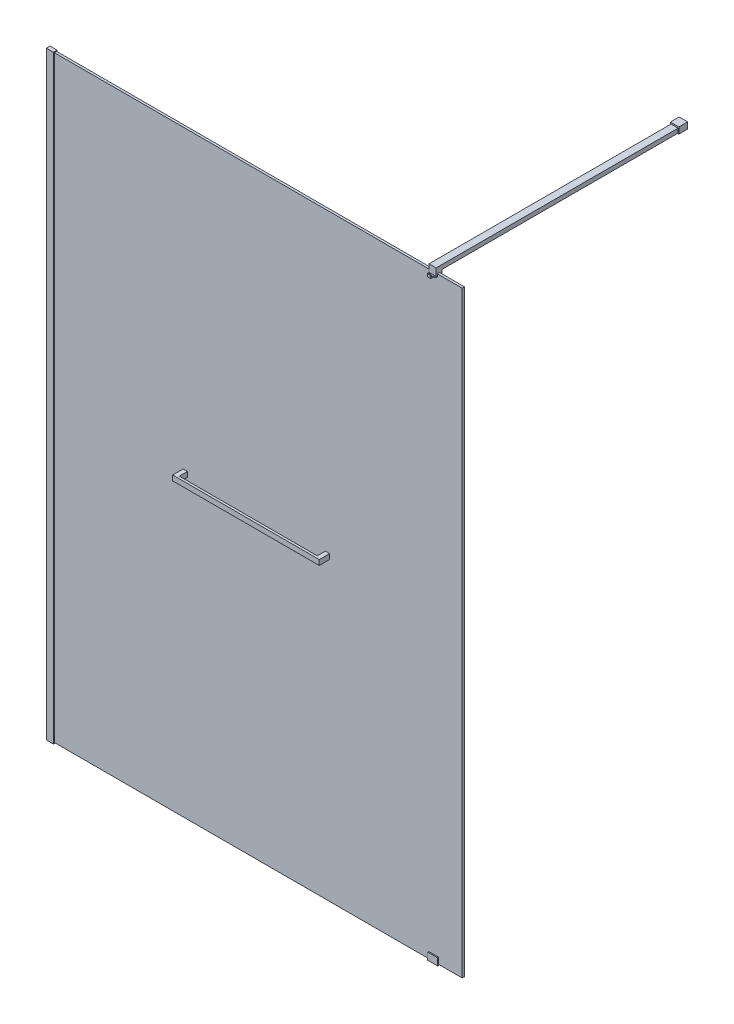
ISO-10303-21;
HEADER;
FILE_DESCRIPTION(('STEP AP214'),'2;1');
FILE_NAME('part.step','',(''),(''),'','','');
FILE_SCHEMA(('AUTOMOTIVE_DESIGN { 1 0 10303 214 1 1 1 1 }'));
ENDSEC;
DATA;
#1=APPLICATION_CONTEXT('core data for automotive mechanical design processes');
#2=APPLICATION_PROTOCOL_DEFINITION('international standard','automotive_design',2000,#1);
#3=PRODUCT_CONTEXT('',#1,'mechanical');
#4=PRODUCT('Part','Part','',(#3));
#5=PRODUCT_RELATED_PRODUCT_CATEGORY('part','',(#4));
#6=PRODUCT_DEFINITION_FORMATION('','',#4);
#7=PRODUCT_DEFINITION_CONTEXT('part definition',#1,'design');
#8=PRODUCT_DEFINITION('design','',#6,#7);
#9=PRODUCT_DEFINITION_SHAPE('','',#8);
#10=(LENGTH_UNIT() NAMED_UNIT(*) SI_UNIT(.MILLI.,.METRE.));
#11=(NAMED_UNIT(*) PLANE_ANGLE_UNIT() SI_UNIT($,.RADIAN.));
#12=(NAMED_UNIT(*) SI_UNIT($,.STERADIAN.) SOLID_ANGLE_UNIT());
#13=UNCERTAINTY_MEASURE_WITH_UNIT(LENGTH_MEASURE(1.E-05),#10,'distance_accuracy_value','');
#14=(GEOMETRIC_REPRESENTATION_CONTEXT(3) GLOBAL_UNCERTAINTY_ASSIGNED_CONTEXT((#13)) GLOBAL_UNIT_ASSIGNED_CONTEXT((#10,
#11,#12)) REPRESENTATION_CONTEXT('',''));
#15=CARTESIAN_POINT('',(0.,0.,0.));
#16=DIRECTION('',(0.,0.,1.));
#17=DIRECTION('',(1.,0.,0.));
#18=AXIS2_PLACEMENT_3D('',#15,#16,#17);
#19=CARTESIAN_POINT('',(992.45,1045.72,-21.6));
#20=DIRECTION('',(1.,0.,0.));
#21=DIRECTION('',(0.,0.,-1.));
#22=AXIS2_PLACEMENT_3D('',#19,#20,#21);
#23=PLANE('',#22);
#24=DIRECTION('',(0.,0.,-1.));
#25=VECTOR('',#24,1.);
#26=CARTESIAN_POINT('',(992.45,1053.72,-21.6));
#27=LINE('',#26,#25);
#28=CARTESIAN_POINT('',(992.45,1053.72,-21.6));
#29=VERTEX_POINT('',#28);
#30=CARTESIAN_POINT('',(992.45,1053.72,-101.6));
#31=VERTEX_POINT('',#30);
#32=EDGE_CURVE('E110',#29,#31,#27,.T.);
#33=ORIENTED_EDGE('',*,*,#32,.F.);
#34=DIRECTION('',(0.,1.,0.));
#35=VECTOR('',#34,1.);
#36=CARTESIAN_POINT('',(992.45,1045.72,-21.6));
#37=LINE('',#36,#35);
#38=CARTESIAN_POINT('',(992.45,1045.72,-21.6));
#39=VERTEX_POINT('',#38);
#40=EDGE_CURVE('E12',#39,#29,#37,.T.);
#41=ORIENTED_EDGE('',*,*,#40,.F.);
#42=DIRECTION('',(0.,0.,-1.));
#43=VECTOR('',#42,1.);
#44=CARTESIAN_POINT('',(992.45,1045.72,-21.6));
#45=LINE('',#44,#43);
#46=CARTESIAN_POINT('',(992.45,1045.72,-101.6));
#47=VERTEX_POINT('',#46);
#48=EDGE_CURVE('E104',#39,#47,#45,.T.);
#49=ORIENTED_EDGE('',*,*,#48,.T.);
#50=DIRECTION('',(0.,1.,0.));
#51=VECTOR('',#50,1.);
#52=CARTESIAN_POINT('',(992.45,1045.72,-101.6));
#53=LINE('',#52,#51);
#54=EDGE_CURVE('E49',#47,#31,#53,.T.);
#55=ORIENTED_EDGE('',*,*,#54,.T.);
#56=EDGE_LOOP('',(#33,#41,#49,#55));
#57=FACE_BOUND('',#56,.T.);
#58=ADVANCED_FACE('F46',(#57),#23,.T.);
#59=CARTESIAN_POINT('',(992.45,1045.72,-21.6));
#60=DIRECTION('',(0.,0.,1.));
#61=DIRECTION('',(1.,0.,0.));
#62=AXIS2_PLACEMENT_3D('',#59,#60,#61);
#63=PLANE('',#62);
#64=DIRECTION('',(1.,0.,0.));
#65=VECTOR('',#64,1.);
#66=CARTESIAN_POINT('',(992.45,1053.72,-21.6));
#67=LINE('',#66,#65);
#68=CARTESIAN_POINT('',(477.45,1053.72,-21.6));
#69=VERTEX_POINT('',#68);
#70=EDGE_CURVE('E106',#69,#29,#67,.T.);
#71=ORIENTED_EDGE('',*,*,#70,.F.);
#72=DIRECTION('',(0.,1.,0.));
#73=VECTOR('',#72,1.);
#74=CARTESIAN_POINT('',(477.45,1045.72,-21.6));
#75=LINE('',#74,#73);
#76=CARTESIAN_POINT('',(477.45,1045.72,-21.6));
#77=VERTEX_POINT('',#76);
#78=EDGE_CURVE('E55',#77,#69,#75,.T.);
#79=ORIENTED_EDGE('',*,*,#78,.F.);
#80=DIRECTION('',(1.,0.,0.));
#81=VECTOR('',#80,1.);
#82=CARTESIAN_POINT('',(992.45,1045.72,-21.6));
#83=LINE('',#82,#81);
#84=EDGE_CURVE('E101',#77,#39,#83,.T.);
#85=ORIENTED_EDGE('',*,*,#84,.T.);
#86=ORIENTED_EDGE('',*,*,#40,.T.);
#87=EDGE_LOOP('',(#71,#79,#85,#86));
#88=FACE_BOUND('',#87,.T.);
#89=ADVANCED_FACE('F120',(#88),#63,.T.);
#90=CARTESIAN_POINT('',(477.45,1045.72,-21.6));
#91=DIRECTION('',(-1.,0.,0.));
#92=DIRECTION('',(0.,0.,1.));
#93=AXIS2_PLACEMENT_3D('',#90,#91,#92);
#94=PLANE('',#93);
#95=DIRECTION('',(0.,0.,1.));
#96=VECTOR('',#95,1.);
#97=CARTESIAN_POINT('',(477.45,1053.72,-21.6));
#98=LINE('',#97,#96);
#99=CARTESIAN_POINT('',(477.45,1053.72,-101.6));
#100=VERTEX_POINT('',#99);
#101=EDGE_CURVE('E96',#100,#69,#98,.T.);
#102=ORIENTED_EDGE('',*,*,#101,.F.);
#103=DIRECTION('',(0.,1.,0.));
#104=VECTOR('',#103,1.);
#105=CARTESIAN_POINT('',(477.45,1045.72,-101.6));
#106=LINE('',#105,#104);
#107=CARTESIAN_POINT('',(477.45,1045.72,-101.6));
#108=VERTEX_POINT('',#107);
#109=EDGE_CURVE('E91',#108,#100,#106,.T.);
#110=ORIENTED_EDGE('',*,*,#109,.F.);
#111=DIRECTION('',(0.,0.,1.));
#112=VECTOR('',#111,1.);
#113=CARTESIAN_POINT('',(477.45,1045.72,-21.6));
#114=LINE('',#113,#112);
#115=EDGE_CURVE('E94',#108,#77,#114,.T.);
#116=ORIENTED_EDGE('',*,*,#115,.T.);
#117=ORIENTED_EDGE('',*,*,#78,.T.);
#118=EDGE_LOOP('',(#102,#110,#116,#117));
#119=FACE_BOUND('',#118,.T.);
#120=ADVANCED_FACE('F93',(#119),#94,.T.);
#121=CARTESIAN_POINT('',(992.45,1045.72,-101.6));
#122=DIRECTION('',(0.,0.,-1.));
#123=DIRECTION('',(-1.,0.,0.));
#124=AXIS2_PLACEMENT_3D('',#121,#122,#123);
#125=PLANE('',#124);
#126=DIRECTION('',(-1.,0.,0.));
#127=VECTOR('',#126,1.);
#128=CARTESIAN_POINT('',(992.45,1053.72,-101.6));
#129=LINE('',#128,#127);
#130=EDGE_CURVE('E113',#31,#100,#129,.T.);
#131=ORIENTED_EDGE('',*,*,#130,.F.);
#132=ORIENTED_EDGE('',*,*,#54,.F.);
#133=DIRECTION('',(-1.,0.,0.));
#134=VECTOR('',#133,1.);
#135=CARTESIAN_POINT('',(992.45,1045.72,-101.6));
#136=LINE('',#135,#134);
#137=EDGE_CURVE('E100',#47,#108,#136,.T.);
#138=ORIENTED_EDGE('',*,*,#137,.T.);
#139=ORIENTED_EDGE('',*,*,#109,.T.);
#140=EDGE_LOOP('',(#131,#132,#138,#139));
#141=FACE_BOUND('',#140,.T.);
#142=ADVANCED_FACE('F103',(#141),#125,.T.);
#143=CARTESIAN_POINT('',(992.45,1045.72,-101.6));
#144=DIRECTION('',(0.,1.,0.));
#145=DIRECTION('',(0.,0.,1.));
#146=AXIS2_PLACEMENT_3D('',#143,#144,#145);
#147=PLANE('',#146);
#148=ORIENTED_EDGE('',*,*,#48,.F.);
#149=ORIENTED_EDGE('',*,*,#84,.F.);
#150=ORIENTED_EDGE('',*,*,#115,.F.);
#151=ORIENTED_EDGE('',*,*,#137,.F.);
#152=EDGE_LOOP('',(#148,#149,#150,#151));
#153=FACE_BOUND('',#152,.T.);
#154=ADVANCED_FACE('F99',(#153),#147,.F.);
#155=CARTESIAN_POINT('',(992.45,1053.72,-101.6));
#156=DIRECTION('',(0.,1.,0.));
#157=DIRECTION('',(0.,0.,1.));
#158=AXIS2_PLACEMENT_3D('',#155,#156,#157);
#159=PLANE('',#158);
#160=ORIENTED_EDGE('',*,*,#32,.T.);
#161=ORIENTED_EDGE('',*,*,#130,.T.);
#162=ORIENTED_EDGE('',*,*,#101,.T.);
#163=ORIENTED_EDGE('',*,*,#70,.T.);
#164=EDGE_LOOP('',(#160,#161,#162,#163));
#165=FACE_BOUND('',#164,.T.);
#166=ADVANCED_FACE('F119',(#165),#159,.T.);
#167=CLOSED_SHELL('',(#58,#89,#120,#142,#154,#166));
#168=MANIFOLD_SOLID_BREP('B2',#167);
#169=CARTESIAN_POINT('',(492.45,1041.,-34.4));
#170=DIRECTION('',(0.,0.,1.));
#171=DIRECTION('',(1.,0.,0.));
#172=AXIS2_PLACEMENT_3D('',#169,#170,#171);
#173=PLANE('',#172);
#174=DIRECTION('',(0.,-1.,0.));
#175=VECTOR('',#174,1.);
#176=CARTESIAN_POINT('',(477.45,1059.,-34.4));
#177=LINE('',#176,#175);
#178=CARTESIAN_POINT('',(477.45,1045.73,-34.4));
#179=VERTEX_POINT('',#178);
#180=CARTESIAN_POINT('',(477.45,1041.,-34.4));
#181=VERTEX_POINT('',#180);
#182=EDGE_CURVE('E415',#179,#181,#177,.T.);
#183=ORIENTED_EDGE('',*,*,#182,.F.);
#184=DIRECTION('',(1.,0.,0.));
#185=VECTOR('',#184,1.);
#186=CARTESIAN_POINT('',(492.45,1045.73,-34.4));
#187=LINE('',#186,#185);
#188=CARTESIAN_POINT('',(492.45,1045.73,-34.4));
#189=VERTEX_POINT('',#188);
#190=EDGE_CURVE('E44',#179,#189,#187,.T.);
#191=ORIENTED_EDGE('',*,*,#190,.T.);
#192=DIRECTION('',(0.,1.,0.));
#193=VECTOR('',#192,1.);
#194=CARTESIAN_POINT('',(492.45,1059.,-34.4));
#195=LINE('',#194,#193);
#196=CARTESIAN_POINT('',(492.45,1041.,-34.4));
#197=VERTEX_POINT('',#196);
#198=EDGE_CURVE('E420',#197,#189,#195,.T.);
#199=ORIENTED_EDGE('',*,*,#198,.F.);
#200=DIRECTION('',(1.,0.,0.));
#201=VECTOR('',#200,1.);
#202=CARTESIAN_POINT('',(477.45,1041.,-34.4));
#203=LINE('',#202,#201);
#204=EDGE_CURVE('E394',#181,#197,#203,.T.);
#205=ORIENTED_EDGE('',*,*,#204,.F.);
#206=EDGE_LOOP('',(#183,#191,#199,#205));
#207=FACE_BOUND('',#206,.T.);
#208=ADVANCED_FACE('F180',(#207),#173,.F.);
#209=CARTESIAN_POINT('',(492.45,1059.,-34.4));
#210=DIRECTION('',(1.,0.,0.));
#211=DIRECTION('',(0.,0.,-1.));
#212=AXIS2_PLACEMENT_3D('',#209,#210,#211);
#213=PLANE('',#212);
#214=DIRECTION('',(0.,1.,0.));
#215=VECTOR('',#214,1.);
#216=CARTESIAN_POINT('',(492.45,1059.,25.1));
#217=LINE('',#216,#215);
#218=CARTESIAN_POINT('',(492.45,1041.,25.1));
#219=VERTEX_POINT('',#218);
#220=CARTESIAN_POINT('',(492.45,1059.,25.1));
#221=VERTEX_POINT('',#220);
#222=EDGE_CURVE('E198',#219,#221,#217,.T.);
#223=ORIENTED_EDGE('',*,*,#222,.F.);
#224=DIRECTION('',(0.,0.,1.));
#225=VECTOR('',#224,1.);
#226=CARTESIAN_POINT('',(492.45,1041.,-34.4));
#227=LINE('',#226,#225);
#228=EDGE_CURVE('E385',#197,#219,#227,.T.);
#229=ORIENTED_EDGE('',*,*,#228,.F.);
#230=ORIENTED_EDGE('',*,*,#198,.T.);
#231=DIRECTION('',(0.,0.,-1.));
#232=VECTOR('',#231,1.);
#233=CARTESIAN_POINT('',(492.45,1045.73,-34.4));
#234=LINE('',#233,#232);
#235=CARTESIAN_POINT('',(492.45,1045.73,-21.6));
#236=VERTEX_POINT('',#235);
#237=EDGE_CURVE('E433',#236,#189,#234,.T.);
#238=ORIENTED_EDGE('',*,*,#237,.F.);
#239=DIRECTION('',(0.,-1.,0.));
#240=VECTOR('',#239,1.);
#241=CARTESIAN_POINT('',(492.45,1059.,-21.6));
#242=LINE('',#241,#240);
#243=CARTESIAN_POINT('',(492.45,1053.73,-21.6));
#244=VERTEX_POINT('',#243);
#245=EDGE_CURVE('E431',#244,#236,#242,.T.);
#246=ORIENTED_EDGE('',*,*,#245,.F.);
#247=DIRECTION('',(0.,0.,1.));
#248=VECTOR('',#247,1.);
#249=CARTESIAN_POINT('',(492.45,1053.73,-34.4));
#250=LINE('',#249,#248);
#251=CARTESIAN_POINT('',(492.45,1053.73,-34.4));
#252=VERTEX_POINT('',#251);
#253=EDGE_CURVE('E435',#252,#244,#250,.T.);
#254=ORIENTED_EDGE('',*,*,#253,.F.);
#255=CARTESIAN_POINT('',(492.45,1059.,-34.4));
#256=VERTEX_POINT('',#255);
#257=EDGE_CURVE('E408',#252,#256,#195,.T.);
#258=ORIENTED_EDGE('',*,*,#257,.T.);
#259=DIRECTION('',(0.,0.,1.));
#260=VECTOR('',#259,1.);
#261=CARTESIAN_POINT('',(492.45,1059.,-34.4));
#262=LINE('',#261,#260);
#263=EDGE_CURVE('E389',#256,#221,#262,.T.);
#264=ORIENTED_EDGE('',*,*,#263,.T.);
#265=EDGE_LOOP('',(#223,#229,#230,#238,#246,#254,#258,#264));
#266=FACE_BOUND('',#265,.T.);
#267=ADVANCED_FACE('F182',(#266),#213,.T.);
#268=CARTESIAN_POINT('',(477.45,1041.,-34.4));
#269=DIRECTION('',(0.,-1.,0.));
#270=DIRECTION('',(0.,0.,-1.));
#271=AXIS2_PLACEMENT_3D('',#268,#269,#270);
#272=PLANE('',#271);
#273=ORIENTED_EDGE('',*,*,#228,.T.);
#274=DIRECTION('',(-1.,0.,0.));
#275=VECTOR('',#274,1.);
#276=CARTESIAN_POINT('',(997.147715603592,1041.,25.1));
#277=LINE('',#276,#275);
#278=CARTESIAN_POINT('',(977.45,1041.,25.1));
#279=VERTEX_POINT('',#278);
#280=EDGE_CURVE('E373',#279,#219,#277,.T.);
#281=ORIENTED_EDGE('',*,*,#280,.F.);
#282=DIRECTION('',(0.,0.,1.));
#283=VECTOR('',#282,1.);
#284=CARTESIAN_POINT('',(977.45,1041.,-34.4));
#285=LINE('',#284,#283);
#286=CARTESIAN_POINT('',(977.45,1041.,-34.4));
#287=VERTEX_POINT('',#286);
#288=EDGE_CURVE('E352',#287,#279,#285,.T.);
#289=ORIENTED_EDGE('',*,*,#288,.F.);
#290=DIRECTION('',(1.,0.,0.));
#291=VECTOR('',#290,1.);
#292=CARTESIAN_POINT('',(977.45,1041.,-34.4));
#293=LINE('',#292,#291);
#294=CARTESIAN_POINT('',(992.45,1041.,-34.4));
#295=VERTEX_POINT('',#294);
#296=EDGE_CURVE('E344',#287,#295,#293,.T.);
#297=ORIENTED_EDGE('',*,*,#296,.T.);
#298=DIRECTION('',(0.,0.,1.));
#299=VECTOR('',#298,1.);
#300=CARTESIAN_POINT('',(992.45,1041.,-34.4));
#301=LINE('',#300,#299);
#302=CARTESIAN_POINT('',(992.45,1041.,33.1));
#303=VERTEX_POINT('',#302);
#304=EDGE_CURVE('E348',#295,#303,#301,.T.);
#305=ORIENTED_EDGE('',*,*,#304,.T.);
#306=DIRECTION('',(1.,0.,0.));
#307=VECTOR('',#306,1.);
#308=CARTESIAN_POINT('',(477.45,1041.,33.1));
#309=LINE('',#308,#307);
#310=CARTESIAN_POINT('',(477.45,1041.,33.1));
#311=VERTEX_POINT('',#310);
#312=EDGE_CURVE('E423',#311,#303,#309,.T.);
#313=ORIENTED_EDGE('',*,*,#312,.F.);
#314=DIRECTION('',(0.,0.,1.));
#315=VECTOR('',#314,1.);
#316=CARTESIAN_POINT('',(477.45,1041.,-34.4));
#317=LINE('',#316,#315);
#318=EDGE_CURVE('E388',#181,#311,#317,.T.);
#319=ORIENTED_EDGE('',*,*,#318,.F.);
#320=ORIENTED_EDGE('',*,*,#204,.T.);
#321=EDGE_LOOP('',(#273,#281,#289,#297,#305,#313,#319,#320));
#322=FACE_BOUND('',#321,.T.);
#323=ADVANCED_FACE('F456',(#322),#272,.T.);
#324=CARTESIAN_POINT('',(477.45,1059.,-34.4));
#325=DIRECTION('',(-1.,0.,0.));
#326=DIRECTION('',(0.,0.,1.));
#327=AXIS2_PLACEMENT_3D('',#324,#325,#326);
#328=PLANE('',#327);
#329=DIRECTION('',(0.,0.,1.));
#330=VECTOR('',#329,1.);
#331=CARTESIAN_POINT('',(477.45,1045.73,-34.4));
#332=LINE('',#331,#330);
#333=CARTESIAN_POINT('',(477.45,1045.73,-21.6));
#334=VERTEX_POINT('',#333);
#335=EDGE_CURVE('E379',#179,#334,#332,.T.);
#336=ORIENTED_EDGE('',*,*,#335,.F.);
#337=ORIENTED_EDGE('',*,*,#182,.T.);
#338=ORIENTED_EDGE('',*,*,#318,.T.);
#339=DIRECTION('',(0.,-1.,0.));
#340=VECTOR('',#339,1.);
#341=CARTESIAN_POINT('',(477.45,1059.,33.1));
#342=LINE('',#341,#340);
#343=CARTESIAN_POINT('',(477.45,1059.,33.1));
#344=VERTEX_POINT('',#343);
#345=EDGE_CURVE('E425',#344,#311,#342,.T.);
#346=ORIENTED_EDGE('',*,*,#345,.F.);
#347=DIRECTION('',(0.,0.,1.));
#348=VECTOR('',#347,1.);
#349=CARTESIAN_POINT('',(477.45,1059.,-34.4));
#350=LINE('',#349,#348);
#351=CARTESIAN_POINT('',(477.45,1059.,-34.4));
#352=VERTEX_POINT('',#351);
#353=EDGE_CURVE('E397',#352,#344,#350,.T.);
#354=ORIENTED_EDGE('',*,*,#353,.F.);
#355=CARTESIAN_POINT('',(477.45,1053.73,-34.4));
#356=VERTEX_POINT('',#355);
#357=EDGE_CURVE('E406',#352,#356,#177,.T.);
#358=ORIENTED_EDGE('',*,*,#357,.T.);
#359=DIRECTION('',(0.,0.,-1.));
#360=VECTOR('',#359,1.);
#361=CARTESIAN_POINT('',(477.45,1053.73,-34.4));
#362=LINE('',#361,#360);
#363=CARTESIAN_POINT('',(477.45,1053.73,-21.6));
#364=VERTEX_POINT('',#363);
#365=EDGE_CURVE('E206',#364,#356,#362,.T.);
#366=ORIENTED_EDGE('',*,*,#365,.F.);
#367=DIRECTION('',(0.,1.,0.));
#368=VECTOR('',#367,1.);
#369=CARTESIAN_POINT('',(477.45,1053.73,-21.6));
#370=LINE('',#369,#368);
#371=EDGE_CURVE('E442',#334,#364,#370,.T.);
#372=ORIENTED_EDGE('',*,*,#371,.F.);
#373=EDGE_LOOP('',(#336,#337,#338,#346,#354,#358,#366,#372));
#374=FACE_BOUND('',#373,.T.);
#375=ADVANCED_FACE('F412',(#374),#328,.T.);
#376=CARTESIAN_POINT('',(477.45,1059.,-34.4));
#377=DIRECTION('',(0.,1.,0.));
#378=DIRECTION('',(0.,0.,1.));
#379=AXIS2_PLACEMENT_3D('',#376,#377,#378);
#380=PLANE('',#379);
#381=ORIENTED_EDGE('',*,*,#353,.T.);
#382=DIRECTION('',(-1.,0.,0.));
#383=VECTOR('',#382,1.);
#384=CARTESIAN_POINT('',(477.45,1059.,33.1));
#385=LINE('',#384,#383);
#386=CARTESIAN_POINT('',(992.45,1059.,33.1));
#387=VERTEX_POINT('',#386);
#388=EDGE_CURVE('E428',#387,#344,#385,.T.);
#389=ORIENTED_EDGE('',*,*,#388,.F.);
#390=DIRECTION('',(0.,0.,1.));
#391=VECTOR('',#390,1.);
#392=CARTESIAN_POINT('',(992.45,1059.,-34.4));
#393=LINE('',#392,#391);
#394=CARTESIAN_POINT('',(992.45,1059.,-34.4));
#395=VERTEX_POINT('',#394);
#396=EDGE_CURVE('E347',#395,#387,#393,.T.);
#397=ORIENTED_EDGE('',*,*,#396,.F.);
#398=DIRECTION('',(-1.,0.,0.));
#399=VECTOR('',#398,1.);
#400=CARTESIAN_POINT('',(977.45,1059.,-34.4));
#401=LINE('',#400,#399);
#402=CARTESIAN_POINT('',(977.45,1059.,-34.4));
#403=VERTEX_POINT('',#402);
#404=EDGE_CURVE('E337',#395,#403,#401,.T.);
#405=ORIENTED_EDGE('',*,*,#404,.T.);
#406=DIRECTION('',(0.,0.,1.));
#407=VECTOR('',#406,1.);
#408=CARTESIAN_POINT('',(977.45,1059.,-34.4));
#409=LINE('',#408,#407);
#410=CARTESIAN_POINT('',(977.45,1059.,25.1));
#411=VERTEX_POINT('',#410);
#412=EDGE_CURVE('E360',#403,#411,#409,.T.);
#413=ORIENTED_EDGE('',*,*,#412,.T.);
#414=DIRECTION('',(-1.,0.,0.));
#415=VECTOR('',#414,1.);
#416=CARTESIAN_POINT('',(997.147715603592,1059.,25.1));
#417=LINE('',#416,#415);
#418=EDGE_CURVE('E370',#411,#221,#417,.T.);
#419=ORIENTED_EDGE('',*,*,#418,.T.);
#420=ORIENTED_EDGE('',*,*,#263,.F.);
#421=DIRECTION('',(-1.,0.,0.));
#422=VECTOR('',#421,1.);
#423=CARTESIAN_POINT('',(477.45,1059.,-34.4));
#424=LINE('',#423,#422);
#425=EDGE_CURVE('E417',#256,#352,#424,.T.);
#426=ORIENTED_EDGE('',*,*,#425,.T.);
#427=EDGE_LOOP('',(#381,#389,#397,#405,#413,#419,#420,#426));
#428=FACE_BOUND('',#427,.T.);
#429=ADVANCED_FACE('F463',(#428),#380,.T.);
#430=ORIENTED_EDGE('',*,*,#257,.F.);
#431=DIRECTION('',(-1.,0.,0.));
#432=VECTOR('',#431,1.);
#433=CARTESIAN_POINT('',(492.45,1053.73,-34.4));
#434=LINE('',#433,#432);
#435=EDGE_CURVE('E190',#252,#356,#434,.T.);
#436=ORIENTED_EDGE('',*,*,#435,.T.);
#437=ORIENTED_EDGE('',*,*,#357,.F.);
#438=ORIENTED_EDGE('',*,*,#425,.F.);
#439=EDGE_LOOP('',(#430,#436,#437,#438));
#440=FACE_BOUND('',#439,.T.);
#441=ADVANCED_FACE('F404',(#440),#173,.F.);
#442=CARTESIAN_POINT('',(492.45,1041.,33.1));
#443=DIRECTION('',(0.,0.,1.));
#444=DIRECTION('',(1.,0.,0.));
#445=AXIS2_PLACEMENT_3D('',#442,#443,#444);
#446=PLANE('',#445);
#447=ORIENTED_EDGE('',*,*,#312,.T.);
#448=DIRECTION('',(0.,1.,0.));
#449=VECTOR('',#448,1.);
#450=CARTESIAN_POINT('',(992.45,1059.,33.1));
#451=LINE('',#450,#449);
#452=EDGE_CURVE('E332',#303,#387,#451,.T.);
#453=ORIENTED_EDGE('',*,*,#452,.T.);
#454=ORIENTED_EDGE('',*,*,#388,.T.);
#455=ORIENTED_EDGE('',*,*,#345,.T.);
#456=EDGE_LOOP('',(#447,#453,#454,#455));
#457=FACE_BOUND('',#456,.T.);
#458=ADVANCED_FACE('F459',(#457),#446,.T.);
#459=CARTESIAN_POINT('',(1007.54436981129,1045.73,-34.4));
#460=DIRECTION('',(0.,-1.,0.));
#461=DIRECTION('',(0.,0.,-1.));
#462=AXIS2_PLACEMENT_3D('',#459,#460,#461);
#463=PLANE('',#462);
#464=ORIENTED_EDGE('',*,*,#237,.T.);
#465=ORIENTED_EDGE('',*,*,#190,.F.);
#466=ORIENTED_EDGE('',*,*,#335,.T.);
#467=DIRECTION('',(-1.,0.,0.));
#468=VECTOR('',#467,1.);
#469=CARTESIAN_POINT('',(1007.54436981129,1045.73,-21.6));
#470=LINE('',#469,#468);
#471=EDGE_CURVE('E438',#236,#334,#470,.T.);
#472=ORIENTED_EDGE('',*,*,#471,.F.);
#473=EDGE_LOOP('',(#464,#465,#466,#472));
#474=FACE_BOUND('',#473,.T.);
#475=ADVANCED_FACE('F498',(#474),#463,.F.);
#476=CARTESIAN_POINT('',(1007.54436981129,1053.73,-21.6));
#477=DIRECTION('',(0.,0.,1.));
#478=DIRECTION('',(1.,0.,0.));
#479=AXIS2_PLACEMENT_3D('',#476,#477,#478);
#480=PLANE('',#479);
#481=ORIENTED_EDGE('',*,*,#245,.T.);
#482=ORIENTED_EDGE('',*,*,#471,.T.);
#483=ORIENTED_EDGE('',*,*,#371,.T.);
#484=DIRECTION('',(-1.,0.,0.));
#485=VECTOR('',#484,1.);
#486=CARTESIAN_POINT('',(1007.54436981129,1053.73,-21.6));
#487=LINE('',#486,#485);
#488=EDGE_CURVE('E437',#244,#364,#487,.T.);
#489=ORIENTED_EDGE('',*,*,#488,.F.);
#490=EDGE_LOOP('',(#481,#482,#483,#489));
#491=FACE_BOUND('',#490,.T.);
#492=ADVANCED_FACE('F446',(#491),#480,.F.);
#493=CARTESIAN_POINT('',(1007.54436981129,1053.73,-34.4));
#494=DIRECTION('',(0.,1.,0.));
#495=DIRECTION('',(0.,0.,1.));
#496=AXIS2_PLACEMENT_3D('',#493,#494,#495);
#497=PLANE('',#496);
#498=ORIENTED_EDGE('',*,*,#253,.T.);
#499=ORIENTED_EDGE('',*,*,#488,.T.);
#500=ORIENTED_EDGE('',*,*,#365,.T.);
#501=ORIENTED_EDGE('',*,*,#435,.F.);
#502=EDGE_LOOP('',(#498,#499,#500,#501));
#503=FACE_BOUND('',#502,.T.);
#504=ADVANCED_FACE('F538',(#503),#497,.F.);
#505=CARTESIAN_POINT('',(997.147715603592,1059.,25.1));
#506=DIRECTION('',(0.,0.,1.));
#507=DIRECTION('',(0.,-1.,0.));
#508=AXIS2_PLACEMENT_3D('',#505,#506,#507);
#509=PLANE('',#508);
#510=ORIENTED_EDGE('',*,*,#418,.F.);
#511=DIRECTION('',(0.,-1.,0.));
#512=VECTOR('',#511,1.);
#513=CARTESIAN_POINT('',(977.45,1059.,25.1));
#514=LINE('',#513,#512);
#515=EDGE_CURVE('E184',#411,#279,#514,.T.);
#516=ORIENTED_EDGE('',*,*,#515,.T.);
#517=ORIENTED_EDGE('',*,*,#280,.T.);
#518=ORIENTED_EDGE('',*,*,#222,.T.);
#519=EDGE_LOOP('',(#510,#516,#517,#518));
#520=FACE_BOUND('',#519,.T.);
#521=ADVANCED_FACE('F470',(#520),#509,.F.);
#522=CARTESIAN_POINT('',(977.45,1059.,-34.4));
#523=DIRECTION('',(-1.,0.,0.));
#524=DIRECTION('',(0.,0.,1.));
#525=AXIS2_PLACEMENT_3D('',#522,#523,#524);
#526=PLANE('',#525);
#527=ORIENTED_EDGE('',*,*,#515,.F.);
#528=ORIENTED_EDGE('',*,*,#412,.F.);
#529=DIRECTION('',(0.,-1.,0.));
#530=VECTOR('',#529,1.);
#531=CARTESIAN_POINT('',(977.45,1059.,-34.4));
#532=LINE('',#531,#530);
#533=CARTESIAN_POINT('',(977.45,1053.73,-34.4));
#534=VERTEX_POINT('',#533);
#535=EDGE_CURVE('E341',#403,#534,#532,.T.);
#536=ORIENTED_EDGE('',*,*,#535,.T.);
#537=DIRECTION('',(0.,0.,-1.));
#538=VECTOR('',#537,1.);
#539=CARTESIAN_POINT('',(977.45,1053.73,-34.4));
#540=LINE('',#539,#538);
#541=CARTESIAN_POINT('',(977.45,1053.73,-21.6));
#542=VERTEX_POINT('',#541);
#543=EDGE_CURVE('E329',#542,#534,#540,.T.);
#544=ORIENTED_EDGE('',*,*,#543,.F.);
#545=DIRECTION('',(0.,1.,0.));
#546=VECTOR('',#545,1.);
#547=CARTESIAN_POINT('',(977.45,1059.,-21.6));
#548=LINE('',#547,#546);
#549=CARTESIAN_POINT('',(977.45,1045.73,-21.6));
#550=VERTEX_POINT('',#549);
#551=EDGE_CURVE('E351',#550,#542,#548,.T.);
#552=ORIENTED_EDGE('',*,*,#551,.F.);
#553=DIRECTION('',(0.,0.,1.));
#554=VECTOR('',#553,1.);
#555=CARTESIAN_POINT('',(977.45,1045.73,-34.4));
#556=LINE('',#555,#554);
#557=CARTESIAN_POINT('',(977.45,1045.73,-34.4));
#558=VERTEX_POINT('',#557);
#559=EDGE_CURVE('E313',#558,#550,#556,.T.);
#560=ORIENTED_EDGE('',*,*,#559,.F.);
#561=EDGE_CURVE('E340',#558,#287,#532,.T.);
#562=ORIENTED_EDGE('',*,*,#561,.T.);
#563=ORIENTED_EDGE('',*,*,#288,.T.);
#564=EDGE_LOOP('',(#527,#528,#536,#544,#552,#560,#562,#563));
#565=FACE_BOUND('',#564,.T.);
#566=ADVANCED_FACE('F471',(#565),#526,.T.);
#567=CARTESIAN_POINT('',(992.45,1041.,-34.4));
#568=DIRECTION('',(0.,0.,1.));
#569=DIRECTION('',(1.,0.,0.));
#570=AXIS2_PLACEMENT_3D('',#567,#568,#569);
#571=PLANE('',#570);
#572=ORIENTED_EDGE('',*,*,#561,.F.);
#573=DIRECTION('',(-1.,0.,0.));
#574=VECTOR('',#573,1.);
#575=CARTESIAN_POINT('',(1007.54436981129,1045.73,-34.4));
#576=LINE('',#575,#574);
#577=CARTESIAN_POINT('',(992.45,1045.73,-34.4));
#578=VERTEX_POINT('',#577);
#579=EDGE_CURVE('E326',#578,#558,#576,.T.);
#580=ORIENTED_EDGE('',*,*,#579,.F.);
#581=DIRECTION('',(0.,1.,0.));
#582=VECTOR('',#581,1.);
#583=CARTESIAN_POINT('',(992.45,1059.,-34.4));
#584=LINE('',#583,#582);
#585=EDGE_CURVE('E318',#295,#578,#584,.T.);
#586=ORIENTED_EDGE('',*,*,#585,.F.);
#587=ORIENTED_EDGE('',*,*,#296,.F.);
#588=EDGE_LOOP('',(#572,#580,#586,#587));
#589=FACE_BOUND('',#588,.T.);
#590=ADVANCED_FACE('F476',(#589),#571,.F.);
#591=CARTESIAN_POINT('',(992.45,1059.,-34.4));
#592=DIRECTION('',(1.,0.,0.));
#593=DIRECTION('',(0.,0.,-1.));
#594=AXIS2_PLACEMENT_3D('',#591,#592,#593);
#595=PLANE('',#594);
#596=DIRECTION('',(0.,0.,1.));
#597=VECTOR('',#596,1.);
#598=CARTESIAN_POINT('',(992.45,1045.73,-34.4));
#599=LINE('',#598,#597);
#600=CARTESIAN_POINT('',(992.45,1045.73,-21.6));
#601=VERTEX_POINT('',#600);
#602=EDGE_CURVE('E310',#578,#601,#599,.T.);
#603=ORIENTED_EDGE('',*,*,#602,.T.);
#604=DIRECTION('',(0.,1.,0.));
#605=VECTOR('',#604,1.);
#606=CARTESIAN_POINT('',(992.45,1053.73,-21.6));
#607=LINE('',#606,#605);
#608=CARTESIAN_POINT('',(992.45,1053.73,-21.6));
#609=VERTEX_POINT('',#608);
#610=EDGE_CURVE('E297',#601,#609,#607,.T.);
#611=ORIENTED_EDGE('',*,*,#610,.T.);
#612=DIRECTION('',(0.,0.,-1.));
#613=VECTOR('',#612,1.);
#614=CARTESIAN_POINT('',(992.45,1053.73,-34.4));
#615=LINE('',#614,#613);
#616=CARTESIAN_POINT('',(992.45,1053.73,-34.4));
#617=VERTEX_POINT('',#616);
#618=EDGE_CURVE('E321',#609,#617,#615,.T.);
#619=ORIENTED_EDGE('',*,*,#618,.T.);
#620=EDGE_CURVE('E335',#617,#395,#584,.T.);
#621=ORIENTED_EDGE('',*,*,#620,.T.);
#622=ORIENTED_EDGE('',*,*,#396,.T.);
#623=ORIENTED_EDGE('',*,*,#452,.F.);
#624=ORIENTED_EDGE('',*,*,#304,.F.);
#625=ORIENTED_EDGE('',*,*,#585,.T.);
#626=EDGE_LOOP('',(#603,#611,#619,#621,#622,#623,#624,#625));
#627=FACE_BOUND('',#626,.T.);
#628=ADVANCED_FACE('F316',(#627),#595,.T.);
#629=ORIENTED_EDGE('',*,*,#620,.F.);
#630=DIRECTION('',(-1.,0.,0.));
#631=VECTOR('',#630,1.);
#632=CARTESIAN_POINT('',(1007.54436981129,1053.73,-34.4));
#633=LINE('',#632,#631);
#634=EDGE_CURVE('E322',#617,#534,#633,.T.);
#635=ORIENTED_EDGE('',*,*,#634,.T.);
#636=ORIENTED_EDGE('',*,*,#535,.F.);
#637=ORIENTED_EDGE('',*,*,#404,.F.);
#638=EDGE_LOOP('',(#629,#635,#636,#637));
#639=FACE_BOUND('',#638,.T.);
#640=ADVANCED_FACE('F467',(#639),#571,.F.);
#641=CARTESIAN_POINT('',(1007.54436981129,1045.73,-34.4));
#642=DIRECTION('',(0.,-1.,0.));
#643=DIRECTION('',(0.,0.,-1.));
#644=AXIS2_PLACEMENT_3D('',#641,#642,#643);
#645=PLANE('',#644);
#646=ORIENTED_EDGE('',*,*,#559,.T.);
#647=DIRECTION('',(-1.,0.,0.));
#648=VECTOR('',#647,1.);
#649=CARTESIAN_POINT('',(1007.54436981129,1045.73,-21.6));
#650=LINE('',#649,#648);
#651=EDGE_CURVE('E300',#601,#550,#650,.T.);
#652=ORIENTED_EDGE('',*,*,#651,.F.);
#653=ORIENTED_EDGE('',*,*,#602,.F.);
#654=ORIENTED_EDGE('',*,*,#579,.T.);
#655=EDGE_LOOP('',(#646,#652,#653,#654));
#656=FACE_BOUND('',#655,.T.);
#657=ADVANCED_FACE('F309',(#656),#645,.F.);
#658=CARTESIAN_POINT('',(1007.54436981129,1053.73,-21.6));
#659=DIRECTION('',(0.,0.,1.));
#660=DIRECTION('',(1.,0.,0.));
#661=AXIS2_PLACEMENT_3D('',#658,#659,#660);
#662=PLANE('',#661);
#663=ORIENTED_EDGE('',*,*,#551,.T.);
#664=DIRECTION('',(-1.,0.,0.));
#665=VECTOR('',#664,1.);
#666=CARTESIAN_POINT('',(1007.54436981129,1053.73,-21.6));
#667=LINE('',#666,#665);
#668=EDGE_CURVE('E303',#609,#542,#667,.T.);
#669=ORIENTED_EDGE('',*,*,#668,.F.);
#670=ORIENTED_EDGE('',*,*,#610,.F.);
#671=ORIENTED_EDGE('',*,*,#651,.T.);
#672=EDGE_LOOP('',(#663,#669,#670,#671));
#673=FACE_BOUND('',#672,.T.);
#674=ADVANCED_FACE('F299',(#673),#662,.F.);
#675=CARTESIAN_POINT('',(1007.54436981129,1053.73,-34.4));
#676=DIRECTION('',(0.,1.,0.));
#677=DIRECTION('',(0.,0.,1.));
#678=AXIS2_PLACEMENT_3D('',#675,#676,#677);
#679=PLANE('',#678);
#680=ORIENTED_EDGE('',*,*,#543,.T.);
#681=ORIENTED_EDGE('',*,*,#634,.F.);
#682=ORIENTED_EDGE('',*,*,#618,.F.);
#683=ORIENTED_EDGE('',*,*,#668,.T.);
#684=EDGE_LOOP('',(#680,#681,#682,#683));
#685=FACE_BOUND('',#684,.T.);
#686=ADVANCED_FACE('F479',(#685),#679,.F.);
#687=CLOSED_SHELL('',(#208,#267,#323,#375,#429,#441,#458,#475,#492,#504,#521,#566,#590,#628,
#640,#657,#674,#686));
#688=MANIFOLD_SOLID_BREP('B6',#687);
#689=CARTESIAN_POINT('',(1370.95,2090.,-19.4000000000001));
#690=DIRECTION('',(-1.,0.,0.));
#691=DIRECTION('',(0.,0.,1.));
#692=AXIS2_PLACEMENT_3D('',#689,#690,#691);
#693=PLANE('',#692);
#694=DIRECTION('',(0.,-1.,0.));
#695=VECTOR('',#694,1.);
#696=CARTESIAN_POINT('',(1370.95,2090.,-850.03));
#697=LINE('',#696,#695);
#698=CARTESIAN_POINT('',(1370.95,2120.,-850.03));
#699=VERTEX_POINT('',#698);
#700=CARTESIAN_POINT('',(1370.95,2105.,-850.03));
#701=VERTEX_POINT('',#700);
#702=EDGE_CURVE('E669',#699,#701,#697,.T.);
#703=ORIENTED_EDGE('',*,*,#702,.F.);
#704=DIRECTION('',(0.,0.,1.));
#705=VECTOR('',#704,1.);
#706=CARTESIAN_POINT('',(1370.95,2120.,0.599999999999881));
#707=LINE('',#706,#705);
#708=CARTESIAN_POINT('',(1370.95,2120.,0.599999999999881));
#709=VERTEX_POINT('',#708);
#710=EDGE_CURVE('E994',#699,#709,#707,.T.);
#711=ORIENTED_EDGE('',*,*,#710,.T.);
#712=DIRECTION('',(0.,-1.,0.));
#713=VECTOR('',#712,1.);
#714=CARTESIAN_POINT('',(1370.95,2094.,0.599999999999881));
#715=LINE('',#714,#713);
#716=CARTESIAN_POINT('',(1370.95,2094.,0.599999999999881));
#717=VERTEX_POINT('',#716);
#718=EDGE_CURVE('E996',#709,#717,#715,.T.);
#719=ORIENTED_EDGE('',*,*,#718,.T.);
#720=DIRECTION('',(0.,1.,0.));
#721=VECTOR('',#720,1.);
#722=CARTESIAN_POINT('',(1370.95,2090.,0.599999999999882));
#723=LINE('',#722,#721);
#724=CARTESIAN_POINT('',(1370.95,2090.,0.599999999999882));
#725=VERTEX_POINT('',#724);
#726=EDGE_CURVE('E940',#725,#717,#723,.T.);
#727=ORIENTED_EDGE('',*,*,#726,.F.);
#728=DIRECTION('',(0.,0.,-1.));
#729=VECTOR('',#728,1.);
#730=CARTESIAN_POINT('',(1370.95,2090.,-3.40000000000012));
#731=LINE('',#730,#729);
#732=CARTESIAN_POINT('',(1370.95,2090.,-3.40000000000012));
#733=VERTEX_POINT('',#732);
#734=EDGE_CURVE('E970',#725,#733,#731,.T.);
#735=ORIENTED_EDGE('',*,*,#734,.T.);
#736=DIRECTION('',(0.,1.,-1.30407837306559E-13));
#737=VECTOR('',#736,1.);
#738=CARTESIAN_POINT('',(1370.95,2100.,-3.40000000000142));
#739=LINE('',#738,#737);
#740=CARTESIAN_POINT('',(1370.95,2100.,-3.40000000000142));
#741=VERTEX_POINT('',#740);
#742=EDGE_CURVE('E1000',#733,#741,#739,.T.);
#743=ORIENTED_EDGE('',*,*,#742,.T.);
#744=DIRECTION('',(0.,0.,-1.));
#745=VECTOR('',#744,1.);
#746=CARTESIAN_POINT('',(1370.95,2100.,-11.4000000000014));
#747=LINE('',#746,#745);
#748=CARTESIAN_POINT('',(1370.95,2100.,-11.4000000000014));
#749=VERTEX_POINT('',#748);
#750=EDGE_CURVE('E1002',#741,#749,#747,.T.);
#751=ORIENTED_EDGE('',*,*,#750,.T.);
#752=DIRECTION('',(0.,-1.,1.30451205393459E-13));
#753=VECTOR('',#752,1.);
#754=CARTESIAN_POINT('',(1370.95,2090.,-11.4000000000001));
#755=LINE('',#754,#753);
#756=CARTESIAN_POINT('',(1370.95,2090.,-11.4000000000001));
#757=VERTEX_POINT('',#756);
#758=EDGE_CURVE('E1003',#749,#757,#755,.T.);
#759=ORIENTED_EDGE('',*,*,#758,.T.);
#760=DIRECTION('',(0.,0.,-1.));
#761=VECTOR('',#760,1.);
#762=CARTESIAN_POINT('',(1370.95,2090.,-19.4000000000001));
#763=LINE('',#762,#761);
#764=CARTESIAN_POINT('',(1370.95,2090.,-19.4000000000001));
#765=VERTEX_POINT('',#764);
#766=EDGE_CURVE('E891',#757,#765,#763,.T.);
#767=ORIENTED_EDGE('',*,*,#766,.T.);
#768=DIRECTION('',(0.,1.,0.));
#769=VECTOR('',#768,1.);
#770=CARTESIAN_POINT('',(1370.95,2120.,-19.4000000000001));
#771=LINE('',#770,#769);
#772=CARTESIAN_POINT('',(1370.95,2105.,-19.4000000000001));
#773=VERTEX_POINT('',#772);
#774=EDGE_CURVE('E857',#765,#773,#771,.T.);
#775=ORIENTED_EDGE('',*,*,#774,.T.);
#776=DIRECTION('',(0.,0.,-1.));
#777=VECTOR('',#776,1.);
#778=CARTESIAN_POINT('',(1370.95,2105.,-881.03));
#779=LINE('',#778,#777);
#780=EDGE_CURVE('E856',#773,#701,#779,.T.);
#781=ORIENTED_EDGE('',*,*,#780,.T.);
#782=EDGE_LOOP('',(#703,#711,#719,#727,#735,#743,#751,#759,#767,#775,#781));
#783=FACE_BOUND('',#782,.T.);
#784=ADVANCED_FACE('F654',(#783),#693,.F.);
#785=CARTESIAN_POINT('',(1345.95,2090.,-19.4000000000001));
#786=DIRECTION('',(-1.,0.,0.));
#787=DIRECTION('',(0.,0.,1.));
#788=AXIS2_PLACEMENT_3D('',#785,#786,#787);
#789=PLANE('',#788);
#790=DIRECTION('',(0.,0.,1.));
#791=VECTOR('',#790,1.);
#792=CARTESIAN_POINT('',(1345.95,2120.,0.599999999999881));
#793=LINE('',#792,#791);
#794=CARTESIAN_POINT('',(1345.95,2120.,-850.03));
#795=VERTEX_POINT('',#794);
#796=CARTESIAN_POINT('',(1345.95,2120.,0.599999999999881));
#797=VERTEX_POINT('',#796);
#798=EDGE_CURVE('E880',#795,#797,#793,.T.);
#799=ORIENTED_EDGE('',*,*,#798,.F.);
#800=DIRECTION('',(0.,-1.,0.));
#801=VECTOR('',#800,1.);
#802=CARTESIAN_POINT('',(1345.95,2090.,-850.03));
#803=LINE('',#802,#801);
#804=CARTESIAN_POINT('',(1345.95,2105.,-850.03));
#805=VERTEX_POINT('',#804);
#806=EDGE_CURVE('E838',#795,#805,#803,.T.);
#807=ORIENTED_EDGE('',*,*,#806,.T.);
#808=DIRECTION('',(0.,0.,1.));
#809=VECTOR('',#808,1.);
#810=CARTESIAN_POINT('',(1345.95,2105.,-881.03));
#811=LINE('',#810,#809);
#812=CARTESIAN_POINT('',(1345.95,2105.,-19.4000000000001));
#813=VERTEX_POINT('',#812);
#814=EDGE_CURVE('E846',#805,#813,#811,.T.);
#815=ORIENTED_EDGE('',*,*,#814,.T.);
#816=DIRECTION('',(0.,1.,0.));
#817=VECTOR('',#816,1.);
#818=CARTESIAN_POINT('',(1345.95,2120.,-19.4000000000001));
#819=LINE('',#818,#817);
#820=CARTESIAN_POINT('',(1345.95,2090.,-19.4000000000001));
#821=VERTEX_POINT('',#820);
#822=EDGE_CURVE('E870',#821,#813,#819,.T.);
#823=ORIENTED_EDGE('',*,*,#822,.F.);
#824=DIRECTION('',(0.,0.,-1.));
#825=VECTOR('',#824,1.);
#826=CARTESIAN_POINT('',(1345.95,2090.,-19.4000000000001));
#827=LINE('',#826,#825);
#828=CARTESIAN_POINT('',(1345.95,2090.,-11.4000000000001));
#829=VERTEX_POINT('',#828);
#830=EDGE_CURVE('E904',#829,#821,#827,.T.);
#831=ORIENTED_EDGE('',*,*,#830,.F.);
#832=DIRECTION('',(0.,-1.,1.30451205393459E-13));
#833=VECTOR('',#832,1.);
#834=CARTESIAN_POINT('',(1345.95,2090.,-11.4000000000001));
#835=LINE('',#834,#833);
#836=CARTESIAN_POINT('',(1345.95,2100.,-11.4000000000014));
#837=VERTEX_POINT('',#836);
#838=EDGE_CURVE('E902',#837,#829,#835,.T.);
#839=ORIENTED_EDGE('',*,*,#838,.F.);
#840=DIRECTION('',(0.,0.,-1.));
#841=VECTOR('',#840,1.);
#842=CARTESIAN_POINT('',(1345.95,2100.,-11.4000000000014));
#843=LINE('',#842,#841);
#844=CARTESIAN_POINT('',(1345.95,2100.,-3.40000000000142));
#845=VERTEX_POINT('',#844);
#846=EDGE_CURVE('E900',#845,#837,#843,.T.);
#847=ORIENTED_EDGE('',*,*,#846,.F.);
#848=DIRECTION('',(0.,1.,-1.30407837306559E-13));
#849=VECTOR('',#848,1.);
#850=CARTESIAN_POINT('',(1345.95,2100.,-3.40000000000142));
#851=LINE('',#850,#849);
#852=CARTESIAN_POINT('',(1345.95,2090.,-3.40000000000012));
#853=VERTEX_POINT('',#852);
#854=EDGE_CURVE('E898',#853,#845,#851,.T.);
#855=ORIENTED_EDGE('',*,*,#854,.F.);
#856=DIRECTION('',(0.,0.,-1.));
#857=VECTOR('',#856,1.);
#858=CARTESIAN_POINT('',(1345.95,2090.,-3.40000000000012));
#859=LINE('',#858,#857);
#860=CARTESIAN_POINT('',(1345.95,2090.,0.599999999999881));
#861=VERTEX_POINT('',#860);
#862=EDGE_CURVE('E896',#861,#853,#859,.T.);
#863=ORIENTED_EDGE('',*,*,#862,.F.);
#864=DIRECTION('',(0.,1.,0.));
#865=VECTOR('',#864,1.);
#866=CARTESIAN_POINT('',(1345.95,2090.,0.599999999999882));
#867=LINE('',#866,#865);
#868=CARTESIAN_POINT('',(1345.95,2094.,0.599999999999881));
#869=VERTEX_POINT('',#868);
#870=EDGE_CURVE('E937',#861,#869,#867,.T.);
#871=ORIENTED_EDGE('',*,*,#870,.T.);
#872=DIRECTION('',(0.,-1.,0.));
#873=VECTOR('',#872,1.);
#874=CARTESIAN_POINT('',(1345.95,2094.,0.599999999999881));
#875=LINE('',#874,#873);
#876=EDGE_CURVE('E882',#797,#869,#875,.T.);
#877=ORIENTED_EDGE('',*,*,#876,.F.);
#878=EDGE_LOOP('',(#799,#807,#815,#823,#831,#839,#847,#855,#863,#871,#877));
#879=FACE_BOUND('',#878,.T.);
#880=ADVANCED_FACE('F867',(#879),#789,.T.);
#881=CARTESIAN_POINT('',(1370.95,2120.,0.599999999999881));
#882=DIRECTION('',(0.,-1.,0.));
#883=DIRECTION('',(0.,0.,-1.));
#884=AXIS2_PLACEMENT_3D('',#881,#882,#883);
#885=PLANE('',#884);
#886=DIRECTION('',(1.,0.,0.));
#887=VECTOR('',#886,1.);
#888=CARTESIAN_POINT('',(1370.95,2120.,-850.03));
#889=LINE('',#888,#887);
#890=EDGE_CURVE('E676',#795,#699,#889,.T.);
#891=ORIENTED_EDGE('',*,*,#890,.F.);
#892=ORIENTED_EDGE('',*,*,#798,.T.);
#893=DIRECTION('',(-1.,0.,0.));
#894=VECTOR('',#893,1.);
#895=CARTESIAN_POINT('',(1370.95,2120.,0.599999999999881));
#896=LINE('',#895,#894);
#897=EDGE_CURVE('E934',#709,#797,#896,.T.);
#898=ORIENTED_EDGE('',*,*,#897,.F.);
#899=ORIENTED_EDGE('',*,*,#710,.F.);
#900=EDGE_LOOP('',(#891,#892,#898,#899));
#901=FACE_BOUND('',#900,.T.);
#902=ADVANCED_FACE('F1045',(#901),#885,.F.);
#903=CARTESIAN_POINT('',(1345.95,2105.,-19.4000000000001));
#904=DIRECTION('',(0.,1.,0.));
#905=DIRECTION('',(0.,0.,1.));
#906=AXIS2_PLACEMENT_3D('',#903,#904,#905);
#907=PLANE('',#906);
#908=DIRECTION('',(-1.,0.,0.));
#909=VECTOR('',#908,1.);
#910=CARTESIAN_POINT('',(1345.95,2105.,-850.03));
#911=LINE('',#910,#909);
#912=EDGE_CURVE('E178',#701,#805,#911,.T.);
#913=ORIENTED_EDGE('',*,*,#912,.F.);
#914=ORIENTED_EDGE('',*,*,#780,.F.);
#915=DIRECTION('',(1.,0.,0.));
#916=VECTOR('',#915,1.);
#917=CARTESIAN_POINT('',(1345.95,2105.,-19.4000000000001));
#918=LINE('',#917,#916);
#919=EDGE_CURVE('E852',#813,#773,#918,.T.);
#920=ORIENTED_EDGE('',*,*,#919,.F.);
#921=ORIENTED_EDGE('',*,*,#814,.F.);
#922=EDGE_LOOP('',(#913,#914,#920,#921));
#923=FACE_BOUND('',#922,.T.);
#924=ADVANCED_FACE('F873',(#923),#907,.F.);
#925=CARTESIAN_POINT('',(1370.95,2094.,9.84506801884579));
#926=DIRECTION('',(0.,-1.,0.));
#927=DIRECTION('',(0.,0.,-1.));
#928=AXIS2_PLACEMENT_3D('',#925,#926,#927);
#929=PLANE('',#928);
#930=DIRECTION('',(-0.906307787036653,0.,-0.422618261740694));
#931=VECTOR('',#930,1.);
#932=CARTESIAN_POINT('',(1370.02591161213,2094.,11.8267819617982));
#933=LINE('',#932,#931);
#934=CARTESIAN_POINT('',(1352.45,2094.,3.6309997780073));
#935=VERTEX_POINT('',#934);
#936=EDGE_CURVE('E973',#935,#869,#933,.T.);
#937=ORIENTED_EDGE('',*,*,#936,.F.);
#938=DIRECTION('',(0.,0.,-1.));
#939=VECTOR('',#938,1.);
#940=CARTESIAN_POINT('',(1352.45,2094.,9.84506801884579));
#941=LINE('',#940,#939);
#942=CARTESIAN_POINT('',(1352.45,2094.,9.84506801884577));
#943=VERTEX_POINT('',#942);
#944=EDGE_CURVE('E881',#943,#935,#941,.T.);
#945=ORIENTED_EDGE('',*,*,#944,.F.);
#946=DIRECTION('',(-1.,0.,0.));
#947=VECTOR('',#946,1.);
#948=CARTESIAN_POINT('',(1370.95,2094.,9.84506801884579));
#949=LINE('',#948,#947);
#950=CARTESIAN_POINT('',(1364.45,2094.,9.84506801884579));
#951=VERTEX_POINT('',#950);
#952=EDGE_CURVE('E928',#951,#943,#949,.T.);
#953=ORIENTED_EDGE('',*,*,#952,.F.);
#954=DIRECTION('',(0.,0.,1.));
#955=VECTOR('',#954,1.);
#956=CARTESIAN_POINT('',(1364.45,2094.,9.84506801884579));
#957=LINE('',#956,#955);
#958=CARTESIAN_POINT('',(1364.45,2094.,3.63099977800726));
#959=VERTEX_POINT('',#958);
#960=EDGE_CURVE('E987',#959,#951,#957,.T.);
#961=ORIENTED_EDGE('',*,*,#960,.F.);
#962=DIRECTION('',(-0.906307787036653,0.,0.422618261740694));
#963=VECTOR('',#962,1.);
#964=CARTESIAN_POINT('',(1367.40893350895,2094.,2.25122642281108));
#965=LINE('',#964,#963);
#966=EDGE_CURVE('E972',#717,#959,#965,.T.);
#967=ORIENTED_EDGE('',*,*,#966,.F.);
#968=DIRECTION('',(-1.,0.,0.));
#969=VECTOR('',#968,1.);
#970=CARTESIAN_POINT('',(1370.95,2094.,0.599999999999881));
#971=LINE('',#970,#969);
#972=EDGE_CURVE('E931',#717,#869,#971,.T.);
#973=ORIENTED_EDGE('',*,*,#972,.T.);
#974=EDGE_LOOP('',(#937,#945,#953,#961,#967,#973));
#975=FACE_BOUND('',#974,.T.);
#976=ADVANCED_FACE('F1032',(#975),#929,.F.);
#977=CARTESIAN_POINT('',(1370.95,2100.,10.3700000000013));
#978=DIRECTION('',(0.,-0.087155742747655,0.996194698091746));
#979=DIRECTION('',(0.,-0.996194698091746,-0.087155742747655));
#980=AXIS2_PLACEMENT_3D('',#977,#978,#979);
#981=PLANE('',#980);
#982=DIRECTION('',(0.,-0.996194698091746,-0.087155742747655));
#983=VECTOR('',#982,1.);
#984=CARTESIAN_POINT('',(1352.45,2100.,10.3700000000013));
#985=LINE('',#984,#983);
#986=CARTESIAN_POINT('',(1352.45,2100.,10.3700000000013));
#987=VERTEX_POINT('',#986);
#988=EDGE_CURVE('E884',#987,#943,#985,.T.);
#989=ORIENTED_EDGE('',*,*,#988,.F.);
#990=DIRECTION('',(-1.,0.,0.));
#991=VECTOR('',#990,1.);
#992=CARTESIAN_POINT('',(1370.95,2100.,10.3700000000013));
#993=LINE('',#992,#991);
#994=CARTESIAN_POINT('',(1364.45,2100.,10.3700000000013));
#995=VERTEX_POINT('',#994);
#996=EDGE_CURVE('E925',#995,#987,#993,.T.);
#997=ORIENTED_EDGE('',*,*,#996,.F.);
#998=DIRECTION('',(0.,0.996194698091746,0.087155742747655));
#999=VECTOR('',#998,1.);
#1000=CARTESIAN_POINT('',(1364.45,2100.,10.3700000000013));
#1001=LINE('',#1000,#999);
#1002=EDGE_CURVE('E984',#951,#995,#1001,.T.);
#1003=ORIENTED_EDGE('',*,*,#1002,.F.);
#1004=ORIENTED_EDGE('',*,*,#952,.T.);
#1005=EDGE_LOOP('',(#989,#997,#1003,#1004));
#1006=FACE_BOUND('',#1005,.T.);
#1007=ADVANCED_FACE('F1036',(#1006),#981,.F.);
#1008=CARTESIAN_POINT('',(1370.95,2100.,13.3700000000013));
#1009=DIRECTION('',(0.,-1.,1.48029736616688E-13));
#1010=DIRECTION('',(0.,-1.48029736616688E-13,-1.));
#1011=AXIS2_PLACEMENT_3D('',#1008,#1009,#1010);
#1012=PLANE('',#1011);
#1013=DIRECTION('',(0.,-1.48029736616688E-13,-1.));
#1014=VECTOR('',#1013,1.);
#1015=CARTESIAN_POINT('',(1352.45,2100.,13.3700000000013));
#1016=LINE('',#1015,#1014);
#1017=CARTESIAN_POINT('',(1352.45,2100.,13.3700000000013));
#1018=VERTEX_POINT('',#1017);
#1019=EDGE_CURVE('E990',#1018,#987,#1016,.T.);
#1020=ORIENTED_EDGE('',*,*,#1019,.F.);
#1021=DIRECTION('',(-1.,0.,0.));
#1022=VECTOR('',#1021,1.);
#1023=CARTESIAN_POINT('',(1370.95,2100.,13.3700000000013));
#1024=LINE('',#1023,#1022);
#1025=CARTESIAN_POINT('',(1364.45,2100.,13.3700000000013));
#1026=VERTEX_POINT('',#1025);
#1027=EDGE_CURVE('E922',#1026,#1018,#1024,.T.);
#1028=ORIENTED_EDGE('',*,*,#1027,.F.);
#1029=DIRECTION('',(0.,1.48029736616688E-13,1.));
#1030=VECTOR('',#1029,1.);
#1031=CARTESIAN_POINT('',(1364.45,2100.,13.3700000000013));
#1032=LINE('',#1031,#1030);
#1033=EDGE_CURVE('E976',#995,#1026,#1032,.T.);
#1034=ORIENTED_EDGE('',*,*,#1033,.F.);
#1035=ORIENTED_EDGE('',*,*,#996,.T.);
#1036=EDGE_LOOP('',(#1020,#1028,#1034,#1035));
#1037=FACE_BOUND('',#1036,.T.);
#1038=ADVANCED_FACE('F1039',(#1037),#1012,.F.);
#1039=CARTESIAN_POINT('',(1370.95,2090.,13.3700000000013));
#1040=DIRECTION('',(0.,0.,-1.));
#1041=DIRECTION('',(0.,1.,0.));
#1042=AXIS2_PLACEMENT_3D('',#1039,#1040,#1041);
#1043=PLANE('',#1042);
#1044=ORIENTED_EDGE('',*,*,#1027,.T.);
#1045=DIRECTION('',(0.,-1.,0.));
#1046=VECTOR('',#1045,1.);
#1047=CARTESIAN_POINT('',(1352.45,7948.62948032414,13.3700000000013));
#1048=LINE('',#1047,#1046);
#1049=CARTESIAN_POINT('',(1352.45,2090.,13.3700000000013));
#1050=VERTEX_POINT('',#1049);
#1051=EDGE_CURVE('E953',#1018,#1050,#1048,.T.);
#1052=ORIENTED_EDGE('',*,*,#1051,.T.);
#1053=DIRECTION('',(-1.,0.,0.));
#1054=VECTOR('',#1053,1.);
#1055=CARTESIAN_POINT('',(1370.95,2090.,13.3700000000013));
#1056=LINE('',#1055,#1054);
#1057=CARTESIAN_POINT('',(1364.45,2090.,13.3700000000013));
#1058=VERTEX_POINT('',#1057);
#1059=EDGE_CURVE('E919',#1058,#1050,#1056,.T.);
#1060=ORIENTED_EDGE('',*,*,#1059,.F.);
#1061=DIRECTION('',(0.,-1.,0.));
#1062=VECTOR('',#1061,1.);
#1063=CARTESIAN_POINT('',(1364.45,7948.62948032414,13.3700000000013));
#1064=LINE('',#1063,#1062);
#1065=EDGE_CURVE('E963',#1026,#1058,#1064,.T.);
#1066=ORIENTED_EDGE('',*,*,#1065,.F.);
#1067=EDGE_LOOP('',(#1044,#1052,#1060,#1066));
#1068=FACE_BOUND('',#1067,.T.);
#1069=ADVANCED_FACE('F961',(#1068),#1043,.F.);
#1070=CARTESIAN_POINT('',(1370.95,2090.,-3.40000000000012));
#1071=DIRECTION('',(0.,1.,0.));
#1072=DIRECTION('',(0.,0.,1.));
#1073=AXIS2_PLACEMENT_3D('',#1070,#1071,#1072);
#1074=PLANE('',#1073);
#1075=DIRECTION('',(0.906307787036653,0.,0.422618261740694));
#1076=VECTOR('',#1075,1.);
#1077=CARTESIAN_POINT('',(1364.95275623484,2090.,9.46113075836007));
#1078=LINE('',#1077,#1076);
#1079=CARTESIAN_POINT('',(1352.45,2090.,3.6309997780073));
#1080=VERTEX_POINT('',#1079);
#1081=EDGE_CURVE('E978',#861,#1080,#1078,.T.);
#1082=ORIENTED_EDGE('',*,*,#1081,.F.);
#1083=ORIENTED_EDGE('',*,*,#862,.T.);
#1084=DIRECTION('',(-1.,0.,0.));
#1085=VECTOR('',#1084,1.);
#1086=CARTESIAN_POINT('',(1370.95,2090.,-3.40000000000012));
#1087=LINE('',#1086,#1085);
#1088=EDGE_CURVE('E916',#733,#853,#1087,.T.);
#1089=ORIENTED_EDGE('',*,*,#1088,.F.);
#1090=ORIENTED_EDGE('',*,*,#734,.F.);
#1091=DIRECTION('',(0.906307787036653,0.,-0.422618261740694));
#1092=VECTOR('',#1091,1.);
#1093=CARTESIAN_POINT('',(1372.48208888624,2090.,-0.114424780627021));
#1094=LINE('',#1093,#1092);
#1095=CARTESIAN_POINT('',(1364.45,2090.,3.6309997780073));
#1096=VERTEX_POINT('',#1095);
#1097=EDGE_CURVE('E968',#1096,#725,#1094,.T.);
#1098=ORIENTED_EDGE('',*,*,#1097,.F.);
#1099=DIRECTION('',(0.,0.,-1.));
#1100=VECTOR('',#1099,1.);
#1101=CARTESIAN_POINT('',(1364.45,2090.,-3.40000000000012));
#1102=LINE('',#1101,#1100);
#1103=EDGE_CURVE('E942',#1058,#1096,#1102,.T.);
#1104=ORIENTED_EDGE('',*,*,#1103,.F.);
#1105=ORIENTED_EDGE('',*,*,#1059,.T.);
#1106=DIRECTION('',(0.,0.,1.));
#1107=VECTOR('',#1106,1.);
#1108=CARTESIAN_POINT('',(1352.45,2090.,-3.40000000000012));
#1109=LINE('',#1108,#1107);
#1110=EDGE_CURVE('E662',#1080,#1050,#1109,.T.);
#1111=ORIENTED_EDGE('',*,*,#1110,.F.);
#1112=EDGE_LOOP('',(#1082,#1083,#1089,#1090,#1098,#1104,#1105,#1111));
#1113=FACE_BOUND('',#1112,.T.);
#1114=ADVANCED_FACE('F965',(#1113),#1074,.F.);
#1115=CARTESIAN_POINT('',(1370.95,2120.,-19.4000000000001));
#1116=DIRECTION('',(0.,0.,1.));
#1117=DIRECTION('',(0.,-1.,0.));
#1118=AXIS2_PLACEMENT_3D('',#1115,#1116,#1117);
#1119=PLANE('',#1118);
#1120=ORIENTED_EDGE('',*,*,#822,.T.);
#1121=ORIENTED_EDGE('',*,*,#919,.T.);
#1122=ORIENTED_EDGE('',*,*,#774,.F.);
#1123=DIRECTION('',(-1.,0.,0.));
#1124=VECTOR('',#1123,1.);
#1125=CARTESIAN_POINT('',(1370.95,2090.,-19.4000000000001));
#1126=LINE('',#1125,#1124);
#1127=EDGE_CURVE('E879',#765,#821,#1126,.T.);
#1128=ORIENTED_EDGE('',*,*,#1127,.T.);
#1129=EDGE_LOOP('',(#1120,#1121,#1122,#1128));
#1130=FACE_BOUND('',#1129,.T.);
#1131=ADVANCED_FACE('F656',(#1130),#1119,.F.);
#1132=CARTESIAN_POINT('',(1370.95,2094.,0.599999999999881));
#1133=DIRECTION('',(0.,0.,-1.));
#1134=DIRECTION('',(0.,1.,0.));
#1135=AXIS2_PLACEMENT_3D('',#1132,#1133,#1134);
#1136=PLANE('',#1135);
#1137=ORIENTED_EDGE('',*,*,#876,.T.);
#1138=ORIENTED_EDGE('',*,*,#972,.F.);
#1139=ORIENTED_EDGE('',*,*,#718,.F.);
#1140=ORIENTED_EDGE('',*,*,#897,.T.);
#1141=EDGE_LOOP('',(#1137,#1138,#1139,#1140));
#1142=FACE_BOUND('',#1141,.T.);
#1143=ADVANCED_FACE('F1043',(#1142),#1136,.F.);
#1144=CARTESIAN_POINT('',(1370.95,2100.,-3.40000000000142));
#1145=DIRECTION('',(0.,1.30407837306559E-13,1.));
#1146=DIRECTION('',(0.,-1.,1.30407837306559E-13));
#1147=AXIS2_PLACEMENT_3D('',#1144,#1145,#1146);
#1148=PLANE('',#1147);
#1149=ORIENTED_EDGE('',*,*,#854,.T.);
#1150=DIRECTION('',(-1.,0.,0.));
#1151=VECTOR('',#1150,1.);
#1152=CARTESIAN_POINT('',(1370.95,2100.,-3.40000000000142));
#1153=LINE('',#1152,#1151);
#1154=EDGE_CURVE('E913',#741,#845,#1153,.T.);
#1155=ORIENTED_EDGE('',*,*,#1154,.F.);
#1156=ORIENTED_EDGE('',*,*,#742,.F.);
#1157=ORIENTED_EDGE('',*,*,#1088,.T.);
#1158=EDGE_LOOP('',(#1149,#1155,#1156,#1157));
#1159=FACE_BOUND('',#1158,.T.);
#1160=ADVANCED_FACE('F1021',(#1159),#1148,.F.);
#1161=CARTESIAN_POINT('',(1370.95,2100.,-11.4000000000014));
#1162=DIRECTION('',(0.,1.,0.));
#1163=DIRECTION('',(0.,0.,1.));
#1164=AXIS2_PLACEMENT_3D('',#1161,#1162,#1163);
#1165=PLANE('',#1164);
#1166=ORIENTED_EDGE('',*,*,#846,.T.);
#1167=DIRECTION('',(-1.,0.,0.));
#1168=VECTOR('',#1167,1.);
#1169=CARTESIAN_POINT('',(1370.95,2100.,-11.4000000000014));
#1170=LINE('',#1169,#1168);
#1171=EDGE_CURVE('E910',#749,#837,#1170,.T.);
#1172=ORIENTED_EDGE('',*,*,#1171,.F.);
#1173=ORIENTED_EDGE('',*,*,#750,.F.);
#1174=ORIENTED_EDGE('',*,*,#1154,.T.);
#1175=EDGE_LOOP('',(#1166,#1172,#1173,#1174));
#1176=FACE_BOUND('',#1175,.T.);
#1177=ADVANCED_FACE('F1017',(#1176),#1165,.F.);
#1178=CARTESIAN_POINT('',(1370.95,2090.,-11.4000000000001));
#1179=DIRECTION('',(0.,-1.30451205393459E-13,-1.));
#1180=DIRECTION('',(0.,1.,-1.30451205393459E-13));
#1181=AXIS2_PLACEMENT_3D('',#1178,#1179,#1180);
#1182=PLANE('',#1181);
#1183=ORIENTED_EDGE('',*,*,#838,.T.);
#1184=DIRECTION('',(-1.,0.,0.));
#1185=VECTOR('',#1184,1.);
#1186=CARTESIAN_POINT('',(1370.95,2090.,-11.4000000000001));
#1187=LINE('',#1186,#1185);
#1188=EDGE_CURVE('E907',#757,#829,#1187,.T.);
#1189=ORIENTED_EDGE('',*,*,#1188,.F.);
#1190=ORIENTED_EDGE('',*,*,#758,.F.);
#1191=ORIENTED_EDGE('',*,*,#1171,.T.);
#1192=EDGE_LOOP('',(#1183,#1189,#1190,#1191));
#1193=FACE_BOUND('',#1192,.T.);
#1194=ADVANCED_FACE('F1013',(#1193),#1182,.F.);
#1195=CARTESIAN_POINT('',(1370.95,2090.,-19.4000000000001));
#1196=DIRECTION('',(0.,1.,0.));
#1197=DIRECTION('',(0.,0.,1.));
#1198=AXIS2_PLACEMENT_3D('',#1195,#1196,#1197);
#1199=PLANE('',#1198);
#1200=ORIENTED_EDGE('',*,*,#830,.T.);
#1201=ORIENTED_EDGE('',*,*,#1127,.F.);
#1202=ORIENTED_EDGE('',*,*,#766,.F.);
#1203=ORIENTED_EDGE('',*,*,#1188,.T.);
#1204=EDGE_LOOP('',(#1200,#1201,#1202,#1203));
#1205=FACE_BOUND('',#1204,.T.);
#1206=ADVANCED_FACE('F1008',(#1205),#1199,.F.);
#1207=CARTESIAN_POINT('',(1345.95,7948.62948032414,0.599999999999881));
#1208=DIRECTION('',(-0.422618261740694,0.,0.906307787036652));
#1209=DIRECTION('',(0.906307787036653,0.,0.422618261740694));
#1210=AXIS2_PLACEMENT_3D('',#1207,#1208,#1209);
#1211=PLANE('',#1210);
#1212=DIRECTION('',(0.,-1.,0.));
#1213=VECTOR('',#1212,1.);
#1214=CARTESIAN_POINT('',(1352.45,7948.62948032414,3.6309997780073));
#1215=LINE('',#1214,#1213);
#1216=EDGE_CURVE('E956',#935,#1080,#1215,.T.);
#1217=ORIENTED_EDGE('',*,*,#1216,.F.);
#1218=ORIENTED_EDGE('',*,*,#936,.T.);
#1219=ORIENTED_EDGE('',*,*,#870,.F.);
#1220=ORIENTED_EDGE('',*,*,#1081,.T.);
#1221=EDGE_LOOP('',(#1217,#1218,#1219,#1220));
#1222=FACE_BOUND('',#1221,.T.);
#1223=ADVANCED_FACE('F1040',(#1222),#1211,.T.);
#1224=CARTESIAN_POINT('',(1352.45,7948.62948032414,3.6309997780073));
#1225=DIRECTION('',(-1.,0.,0.));
#1226=DIRECTION('',(0.,0.,1.));
#1227=AXIS2_PLACEMENT_3D('',#1224,#1225,#1226);
#1228=PLANE('',#1227);
#1229=ORIENTED_EDGE('',*,*,#988,.T.);
#1230=ORIENTED_EDGE('',*,*,#944,.T.);
#1231=ORIENTED_EDGE('',*,*,#1216,.T.);
#1232=ORIENTED_EDGE('',*,*,#1110,.T.);
#1233=ORIENTED_EDGE('',*,*,#1051,.F.);
#1234=ORIENTED_EDGE('',*,*,#1019,.T.);
#1235=EDGE_LOOP('',(#1229,#1230,#1231,#1232,#1233,#1234));
#1236=FACE_BOUND('',#1235,.T.);
#1237=ADVANCED_FACE('F952',(#1236),#1228,.T.);
#1238=CARTESIAN_POINT('',(1364.45,7948.62948032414,3.6309997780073));
#1239=DIRECTION('',(1.,0.,0.));
#1240=DIRECTION('',(0.,0.,-1.));
#1241=AXIS2_PLACEMENT_3D('',#1238,#1239,#1240);
#1242=PLANE('',#1241);
#1243=DIRECTION('',(0.,-1.,0.));
#1244=VECTOR('',#1243,1.);
#1245=CARTESIAN_POINT('',(1364.45,7948.62948032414,3.6309997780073));
#1246=LINE('',#1245,#1244);
#1247=EDGE_CURVE('E849',#959,#1096,#1246,.T.);
#1248=ORIENTED_EDGE('',*,*,#1247,.F.);
#1249=ORIENTED_EDGE('',*,*,#960,.T.);
#1250=ORIENTED_EDGE('',*,*,#1002,.T.);
#1251=ORIENTED_EDGE('',*,*,#1033,.T.);
#1252=ORIENTED_EDGE('',*,*,#1065,.T.);
#1253=ORIENTED_EDGE('',*,*,#1103,.T.);
#1254=EDGE_LOOP('',(#1248,#1249,#1250,#1251,#1252,#1253));
#1255=FACE_BOUND('',#1254,.T.);
#1256=ADVANCED_FACE('F1028',(#1255),#1242,.T.);
#1257=CARTESIAN_POINT('',(1370.95,7948.62948032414,0.599999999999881));
#1258=DIRECTION('',(0.422618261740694,0.,0.906307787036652));
#1259=DIRECTION('',(0.906307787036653,0.,-0.422618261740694));
#1260=AXIS2_PLACEMENT_3D('',#1257,#1258,#1259);
#1261=PLANE('',#1260);
#1262=ORIENTED_EDGE('',*,*,#726,.T.);
#1263=ORIENTED_EDGE('',*,*,#966,.T.);
#1264=ORIENTED_EDGE('',*,*,#1247,.T.);
#1265=ORIENTED_EDGE('',*,*,#1097,.T.);
#1266=EDGE_LOOP('',(#1262,#1263,#1264,#1265));
#1267=FACE_BOUND('',#1266,.T.);
#1268=ADVANCED_FACE('F1026',(#1267),#1261,.T.);
#1269=CARTESIAN_POINT('',(1343.44999999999,2103.,-850.03));
#1270=DIRECTION('',(0.,0.,-1.));
#1271=DIRECTION('',(-1.,0.,0.));
#1272=AXIS2_PLACEMENT_3D('',#1269,#1270,#1271);
#1273=PLANE('',#1272);
#1274=DIRECTION('',(0.,1.,0.));
#1275=VECTOR('',#1274,1.);
#1276=CARTESIAN_POINT('',(1343.44999999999,2125.,-850.03));
#1277=LINE('',#1276,#1275);
#1278=CARTESIAN_POINT('',(1343.44999999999,2103.,-850.03));
#1279=VERTEX_POINT('',#1278);
#1280=CARTESIAN_POINT('',(1343.44999999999,2125.,-850.03));
#1281=VERTEX_POINT('',#1280);
#1282=EDGE_CURVE('E817',#1279,#1281,#1277,.T.);
#1283=ORIENTED_EDGE('',*,*,#1282,.F.);
#1284=DIRECTION('',(-1.,0.,0.));
#1285=VECTOR('',#1284,1.);
#1286=CARTESIAN_POINT('',(1373.44999999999,2103.,-850.03));
#1287=LINE('',#1286,#1285);
#1288=CARTESIAN_POINT('',(1373.44999999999,2103.,-850.03));
#1289=VERTEX_POINT('',#1288);
#1290=EDGE_CURVE('E809',#1289,#1279,#1287,.T.);
#1291=ORIENTED_EDGE('',*,*,#1290,.F.);
#1292=DIRECTION('',(0.,-1.,0.));
#1293=VECTOR('',#1292,1.);
#1294=CARTESIAN_POINT('',(1373.44999999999,2125.,-850.03));
#1295=LINE('',#1294,#1293);
#1296=CARTESIAN_POINT('',(1373.44999999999,2125.,-850.03));
#1297=VERTEX_POINT('',#1296);
#1298=EDGE_CURVE('E820',#1297,#1289,#1295,.T.);
#1299=ORIENTED_EDGE('',*,*,#1298,.F.);
#1300=DIRECTION('',(1.,0.,0.));
#1301=VECTOR('',#1300,1.);
#1302=CARTESIAN_POINT('',(1373.44999999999,2125.,-850.03));
#1303=LINE('',#1302,#1301);
#1304=EDGE_CURVE('E801',#1281,#1297,#1303,.T.);
#1305=ORIENTED_EDGE('',*,*,#1304,.F.);
#1306=EDGE_LOOP('',(#1283,#1291,#1299,#1305));
#1307=FACE_BOUND('',#1306,.T.);
#1308=ORIENTED_EDGE('',*,*,#806,.F.);
#1309=ORIENTED_EDGE('',*,*,#890,.T.);
#1310=ORIENTED_EDGE('',*,*,#702,.T.);
#1311=ORIENTED_EDGE('',*,*,#912,.T.);
#1312=EDGE_LOOP('',(#1308,#1309,#1310,#1311));
#1313=FACE_BOUND('',#1312,.T.);
#1314=ADVANCED_FACE('F814',(#1307,#1313),#1273,.F.);
#1315=CARTESIAN_POINT('',(1343.44999999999,2125.,-850.03));
#1316=DIRECTION('',(-1.,0.,0.));
#1317=DIRECTION('',(0.,0.,1.));
#1318=AXIS2_PLACEMENT_3D('',#1315,#1316,#1317);
#1319=PLANE('',#1318);
#1320=DIRECTION('',(0.,1.,0.));
#1321=VECTOR('',#1320,1.);
#1322=CARTESIAN_POINT('',(1343.44999999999,2125.,-881.03));
#1323=LINE('',#1322,#1321);
#1324=CARTESIAN_POINT('',(1343.44999999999,2103.,-881.03));
#1325=VERTEX_POINT('',#1324);
#1326=CARTESIAN_POINT('',(1343.44999999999,2125.,-881.03));
#1327=VERTEX_POINT('',#1326);
#1328=EDGE_CURVE('E832',#1325,#1327,#1323,.T.);
#1329=ORIENTED_EDGE('',*,*,#1328,.F.);
#1330=DIRECTION('',(0.,0.,-1.));
#1331=VECTOR('',#1330,1.);
#1332=CARTESIAN_POINT('',(1343.44999999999,2103.,-850.03));
#1333=LINE('',#1332,#1331);
#1334=EDGE_CURVE('E823',#1279,#1325,#1333,.T.);
#1335=ORIENTED_EDGE('',*,*,#1334,.F.);
#1336=ORIENTED_EDGE('',*,*,#1282,.T.);
#1337=DIRECTION('',(0.,0.,-1.));
#1338=VECTOR('',#1337,1.);
#1339=CARTESIAN_POINT('',(1343.44999999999,2125.,-850.03));
#1340=LINE('',#1339,#1338);
#1341=EDGE_CURVE('E798',#1281,#1327,#1340,.T.);
#1342=ORIENTED_EDGE('',*,*,#1341,.T.);
#1343=EDGE_LOOP('',(#1329,#1335,#1336,#1342));
#1344=FACE_BOUND('',#1343,.T.);
#1345=ADVANCED_FACE('F822',(#1344),#1319,.T.);
#1346=CARTESIAN_POINT('',(1373.44999999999,2103.,-850.03));
#1347=DIRECTION('',(0.,-1.,0.));
#1348=DIRECTION('',(0.,0.,-1.));
#1349=AXIS2_PLACEMENT_3D('',#1346,#1347,#1348);
#1350=PLANE('',#1349);
#1351=DIRECTION('',(-1.,0.,0.));
#1352=VECTOR('',#1351,1.);
#1353=CARTESIAN_POINT('',(1373.44999999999,2103.,-881.03));
#1354=LINE('',#1353,#1352);
#1355=CARTESIAN_POINT('',(1373.44999999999,2103.,-881.03));
#1356=VERTEX_POINT('',#1355);
#1357=EDGE_CURVE('E824',#1356,#1325,#1354,.T.);
#1358=ORIENTED_EDGE('',*,*,#1357,.F.);
#1359=DIRECTION('',(0.,0.,-1.));
#1360=VECTOR('',#1359,1.);
#1361=CARTESIAN_POINT('',(1373.44999999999,2103.,-850.03));
#1362=LINE('',#1361,#1360);
#1363=EDGE_CURVE('E839',#1289,#1356,#1362,.T.);
#1364=ORIENTED_EDGE('',*,*,#1363,.F.);
#1365=ORIENTED_EDGE('',*,*,#1290,.T.);
#1366=ORIENTED_EDGE('',*,*,#1334,.T.);
#1367=EDGE_LOOP('',(#1358,#1364,#1365,#1366));
#1368=FACE_BOUND('',#1367,.T.);
#1369=ADVANCED_FACE('F1052',(#1368),#1350,.T.);
#1370=CARTESIAN_POINT('',(1373.44999999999,2125.,-850.03));
#1371=DIRECTION('',(1.,0.,0.));
#1372=DIRECTION('',(0.,1.,0.));
#1373=AXIS2_PLACEMENT_3D('',#1370,#1371,#1372);
#1374=PLANE('',#1373);
#1375=DIRECTION('',(0.,-1.,0.));
#1376=VECTOR('',#1375,1.);
#1377=CARTESIAN_POINT('',(1373.44999999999,2125.,-881.03));
#1378=LINE('',#1377,#1376);
#1379=CARTESIAN_POINT('',(1373.44999999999,2125.,-881.03));
#1380=VERTEX_POINT('',#1379);
#1381=EDGE_CURVE('E827',#1380,#1356,#1378,.T.);
#1382=ORIENTED_EDGE('',*,*,#1381,.F.);
#1383=DIRECTION('',(0.,0.,-1.));
#1384=VECTOR('',#1383,1.);
#1385=CARTESIAN_POINT('',(1373.44999999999,2125.,-850.03));
#1386=LINE('',#1385,#1384);
#1387=EDGE_CURVE('E808',#1297,#1380,#1386,.T.);
#1388=ORIENTED_EDGE('',*,*,#1387,.F.);
#1389=ORIENTED_EDGE('',*,*,#1298,.T.);
#1390=ORIENTED_EDGE('',*,*,#1363,.T.);
#1391=EDGE_LOOP('',(#1382,#1388,#1389,#1390));
#1392=FACE_BOUND('',#1391,.T.);
#1393=ADVANCED_FACE('F1220',(#1392),#1374,.T.);
#1394=CARTESIAN_POINT('',(1373.44999999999,2125.,-850.03));
#1395=DIRECTION('',(0.,1.,0.));
#1396=DIRECTION('',(0.,0.,1.));
#1397=AXIS2_PLACEMENT_3D('',#1394,#1395,#1396);
#1398=PLANE('',#1397);
#1399=DIRECTION('',(1.,0.,0.));
#1400=VECTOR('',#1399,1.);
#1401=CARTESIAN_POINT('',(1373.44999999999,2125.,-881.03));
#1402=LINE('',#1401,#1400);
#1403=EDGE_CURVE('E803',#1327,#1380,#1402,.T.);
#1404=ORIENTED_EDGE('',*,*,#1403,.F.);
#1405=ORIENTED_EDGE('',*,*,#1341,.F.);
#1406=ORIENTED_EDGE('',*,*,#1304,.T.);
#1407=ORIENTED_EDGE('',*,*,#1387,.T.);
#1408=EDGE_LOOP('',(#1404,#1405,#1406,#1407));
#1409=FACE_BOUND('',#1408,.T.);
#1410=ADVANCED_FACE('F800',(#1409),#1398,.T.);
#1411=CARTESIAN_POINT('',(1345.95,2105.,-881.03));
#1412=DIRECTION('',(0.,0.,-1.));
#1413=DIRECTION('',(-1.,0.,0.));
#1414=AXIS2_PLACEMENT_3D('',#1411,#1412,#1413);
#1415=PLANE('',#1414);
#1416=ORIENTED_EDGE('',*,*,#1328,.T.);
#1417=ORIENTED_EDGE('',*,*,#1403,.T.);
#1418=ORIENTED_EDGE('',*,*,#1381,.T.);
#1419=ORIENTED_EDGE('',*,*,#1357,.T.);
#1420=EDGE_LOOP('',(#1416,#1417,#1418,#1419));
#1421=FACE_BOUND('',#1420,.T.);
#1422=ADVANCED_FACE('F1093',(#1421),#1415,.T.);
#1423=CLOSED_SHELL('',(#784,#880,#902,#924,#976,#1007,#1038,#1069,#1114,#1131,#1143,#1160,#1177,
#1194,#1206,#1223,#1237,#1256,#1268,#1314,#1345,#1369,#1393,#1410,#1422));
#1424=MANIFOLD_SOLID_BREP('B38',#1423);
#1425=CARTESIAN_POINT('',(1375.95,22.,-11.4000000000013));
#1426=DIRECTION('',(0.,0.,-1.));
#1427=DIRECTION('',(0.,1.,0.));
#1428=AXIS2_PLACEMENT_3D('',#1425,#1426,#1427);
#1429=PLANE('',#1428);
#1430=DIRECTION('',(0.,-1.,0.));
#1431=VECTOR('',#1430,1.);
#1432=CARTESIAN_POINT('',(1340.95,22.,-11.4000000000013));
#1433=LINE('',#1432,#1431);
#1434=CARTESIAN_POINT('',(1340.95,22.,-11.4000000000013));
#1435=VERTEX_POINT('',#1434);
#1436=CARTESIAN_POINT('',(1340.95,0.,-11.4));
#1437=VERTEX_POINT('',#1436);
#1438=EDGE_CURVE('E1373',#1435,#1437,#1433,.T.);
#1439=ORIENTED_EDGE('',*,*,#1438,.T.);
#1440=DIRECTION('',(-1.,0.,0.));
#1441=VECTOR('',#1440,1.);
#1442=CARTESIAN_POINT('',(1375.95,0.,-11.4));
#1443=LINE('',#1442,#1441);
#1444=CARTESIAN_POINT('',(1375.95,0.,-11.4));
#1445=VERTEX_POINT('',#1444);
#1446=EDGE_CURVE('E652',#1445,#1437,#1443,.T.);
#1447=ORIENTED_EDGE('',*,*,#1446,.F.);
#1448=DIRECTION('',(0.,-1.,0.));
#1449=VECTOR('',#1448,1.);
#1450=CARTESIAN_POINT('',(1375.95,22.,-11.4000000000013));
#1451=LINE('',#1450,#1449);
#1452=CARTESIAN_POINT('',(1375.95,22.,-11.4000000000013));
#1453=VERTEX_POINT('',#1452);
#1454=EDGE_CURVE('E1387',#1453,#1445,#1451,.T.);
#1455=ORIENTED_EDGE('',*,*,#1454,.F.);
#1456=DIRECTION('',(-1.,0.,0.));
#1457=VECTOR('',#1456,1.);
#1458=CARTESIAN_POINT('',(1375.95,22.,-11.4000000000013));
#1459=LINE('',#1458,#1457);
#1460=EDGE_CURVE('E1369',#1453,#1435,#1459,.T.);
#1461=ORIENTED_EDGE('',*,*,#1460,.T.);
#1462=EDGE_LOOP('',(#1439,#1447,#1455,#1461));
#1463=FACE_BOUND('',#1462,.T.);
#1464=ADVANCED_FACE('F1277',(#1463),#1429,.F.);
#1465=CARTESIAN_POINT('',(1375.95,0.,-11.4));
#1466=DIRECTION('',(0.,-1.,0.));
#1467=DIRECTION('',(0.,0.,-1.));
#1468=AXIS2_PLACEMENT_3D('',#1465,#1466,#1467);
#1469=PLANE('',#1468);
#1470=DIRECTION('',(0.,0.,1.));
#1471=VECTOR('',#1470,1.);
#1472=CARTESIAN_POINT('',(1340.95,0.,-11.4));
#1473=LINE('',#1472,#1471);
#1474=CARTESIAN_POINT('',(1340.95,0.,-3.4));
#1475=VERTEX_POINT('',#1474);
#1476=EDGE_CURVE('E1376',#1437,#1475,#1473,.T.);
#1477=ORIENTED_EDGE('',*,*,#1476,.T.);
#1478=DIRECTION('',(-1.,0.,0.));
#1479=VECTOR('',#1478,1.);
#1480=CARTESIAN_POINT('',(1375.95,0.,-3.4));
#1481=LINE('',#1480,#1479);
#1482=CARTESIAN_POINT('',(1375.95,0.,-3.4));
#1483=VERTEX_POINT('',#1482);
#1484=EDGE_CURVE('E1285',#1483,#1475,#1481,.T.);
#1485=ORIENTED_EDGE('',*,*,#1484,.F.);
#1486=DIRECTION('',(0.,0.,1.));
#1487=VECTOR('',#1486,1.);
#1488=CARTESIAN_POINT('',(1375.95,0.,-11.4));
#1489=LINE('',#1488,#1487);
#1490=EDGE_CURVE('E1336',#1445,#1483,#1489,.T.);
#1491=ORIENTED_EDGE('',*,*,#1490,.F.);
#1492=ORIENTED_EDGE('',*,*,#1446,.T.);
#1493=EDGE_LOOP('',(#1477,#1485,#1491,#1492));
#1494=FACE_BOUND('',#1493,.T.);
#1495=ADVANCED_FACE('F1422',(#1494),#1469,.F.);
#1496=CARTESIAN_POINT('',(1375.95,0.,-3.4));
#1497=DIRECTION('',(0.,0.,1.));
#1498=DIRECTION('',(0.,-1.,0.));
#1499=AXIS2_PLACEMENT_3D('',#1496,#1497,#1498);
#1500=PLANE('',#1499);
#1501=DIRECTION('',(0.,1.,0.));
#1502=VECTOR('',#1501,1.);
#1503=CARTESIAN_POINT('',(1340.95,0.,-3.4));
#1504=LINE('',#1503,#1502);
#1505=CARTESIAN_POINT('',(1340.95,21.9999999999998,-3.4000000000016));
#1506=VERTEX_POINT('',#1505);
#1507=EDGE_CURVE('E1378',#1475,#1506,#1504,.T.);
#1508=ORIENTED_EDGE('',*,*,#1507,.T.);
#1509=DIRECTION('',(-1.,0.,0.));
#1510=VECTOR('',#1509,1.);
#1511=CARTESIAN_POINT('',(1375.95,21.9999999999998,-3.4000000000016));
#1512=LINE('',#1511,#1510);
#1513=CARTESIAN_POINT('',(1375.95,21.9999999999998,-3.4000000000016));
#1514=VERTEX_POINT('',#1513);
#1515=EDGE_CURVE('E1394',#1514,#1506,#1512,.T.);
#1516=ORIENTED_EDGE('',*,*,#1515,.F.);
#1517=DIRECTION('',(0.,1.,0.));
#1518=VECTOR('',#1517,1.);
#1519=CARTESIAN_POINT('',(1375.95,0.,-3.4));
#1520=LINE('',#1519,#1518);
#1521=EDGE_CURVE('E1402',#1483,#1514,#1520,.T.);
#1522=ORIENTED_EDGE('',*,*,#1521,.F.);
#1523=ORIENTED_EDGE('',*,*,#1484,.T.);
#1524=EDGE_LOOP('',(#1508,#1516,#1522,#1523));
#1525=FACE_BOUND('',#1524,.T.);
#1526=ADVANCED_FACE('F1400',(#1525),#1500,.F.);
#1527=CARTESIAN_POINT('',(1375.95,22.,0.349999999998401));
#1528=DIRECTION('',(0.,-1.,0.));
#1529=DIRECTION('',(0.,0.,-1.));
#1530=AXIS2_PLACEMENT_3D('',#1527,#1528,#1529);
#1531=PLANE('',#1530);
#1532=DIRECTION('',(0.,0.,1.));
#1533=VECTOR('',#1532,1.);
#1534=CARTESIAN_POINT('',(1340.95,22.,0.349999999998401));
#1535=LINE('',#1534,#1533);
#1536=CARTESIAN_POINT('',(1340.95,22.,0.349999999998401));
#1537=VERTEX_POINT('',#1536);
#1538=EDGE_CURVE('E1380',#1506,#1537,#1535,.T.);
#1539=ORIENTED_EDGE('',*,*,#1538,.T.);
#1540=DIRECTION('',(-1.,0.,0.));
#1541=VECTOR('',#1540,1.);
#1542=CARTESIAN_POINT('',(1375.95,22.,0.349999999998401));
#1543=LINE('',#1542,#1541);
#1544=CARTESIAN_POINT('',(1375.95,22.,0.349999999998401));
#1545=VERTEX_POINT('',#1544);
#1546=EDGE_CURVE('E1391',#1545,#1537,#1543,.T.);
#1547=ORIENTED_EDGE('',*,*,#1546,.F.);
#1548=DIRECTION('',(0.,0.,1.));
#1549=VECTOR('',#1548,1.);
#1550=CARTESIAN_POINT('',(1375.95,22.,0.349999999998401));
#1551=LINE('',#1550,#1549);
#1552=EDGE_CURVE('E1414',#1514,#1545,#1551,.T.);
#1553=ORIENTED_EDGE('',*,*,#1552,.F.);
#1554=ORIENTED_EDGE('',*,*,#1515,.T.);
#1555=EDGE_LOOP('',(#1539,#1547,#1553,#1554));
#1556=FACE_BOUND('',#1555,.T.);
#1557=ADVANCED_FACE('F1410',(#1556),#1531,.F.);
#1558=CARTESIAN_POINT('',(1375.95,-3.,0.349999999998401));
#1559=DIRECTION('',(0.,0.,-1.));
#1560=DIRECTION('',(-1.,0.,0.));
#1561=AXIS2_PLACEMENT_3D('',#1558,#1559,#1560);
#1562=PLANE('',#1561);
#1563=DIRECTION('',(0.,-1.,0.));
#1564=VECTOR('',#1563,1.);
#1565=CARTESIAN_POINT('',(1340.95,-3.,0.349999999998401));
#1566=LINE('',#1565,#1564);
#1567=CARTESIAN_POINT('',(1340.95,-3.,0.349999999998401));
#1568=VERTEX_POINT('',#1567);
#1569=EDGE_CURVE('E1382',#1537,#1568,#1566,.T.);
#1570=ORIENTED_EDGE('',*,*,#1569,.T.);
#1571=DIRECTION('',(-1.,0.,0.));
#1572=VECTOR('',#1571,1.);
#1573=CARTESIAN_POINT('',(1375.95,-3.,0.349999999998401));
#1574=LINE('',#1573,#1572);
#1575=CARTESIAN_POINT('',(1375.95,-3.,0.349999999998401));
#1576=VERTEX_POINT('',#1575);
#1577=EDGE_CURVE('E1364',#1576,#1568,#1574,.T.);
#1578=ORIENTED_EDGE('',*,*,#1577,.F.);
#1579=DIRECTION('',(0.,-1.,0.));
#1580=VECTOR('',#1579,1.);
#1581=CARTESIAN_POINT('',(1375.95,-3.,0.349999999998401));
#1582=LINE('',#1581,#1580);
#1583=EDGE_CURVE('E1355',#1545,#1576,#1582,.T.);
#1584=ORIENTED_EDGE('',*,*,#1583,.F.);
#1585=ORIENTED_EDGE('',*,*,#1546,.T.);
#1586=EDGE_LOOP('',(#1570,#1578,#1584,#1585));
#1587=FACE_BOUND('',#1586,.T.);
#1588=ADVANCED_FACE('F1413',(#1587),#1562,.F.);
#1589=CARTESIAN_POINT('',(1375.95,-3.,-15.7500000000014));
#1590=DIRECTION('',(0.,1.,0.));
#1591=DIRECTION('',(0.,0.,1.));
#1592=AXIS2_PLACEMENT_3D('',#1589,#1590,#1591);
#1593=PLANE('',#1592);
#1594=DIRECTION('',(0.,0.,-1.));
#1595=VECTOR('',#1594,1.);
#1596=CARTESIAN_POINT('',(1340.95,-3.,-15.7500000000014));
#1597=LINE('',#1596,#1595);
#1598=CARTESIAN_POINT('',(1340.95,-3.,-15.7500000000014));
#1599=VERTEX_POINT('',#1598);
#1600=EDGE_CURVE('E1363',#1568,#1599,#1597,.T.);
#1601=ORIENTED_EDGE('',*,*,#1600,.T.);
#1602=DIRECTION('',(-1.,0.,0.));
#1603=VECTOR('',#1602,1.);
#1604=CARTESIAN_POINT('',(1375.95,-3.,-15.7500000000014));
#1605=LINE('',#1604,#1603);
#1606=CARTESIAN_POINT('',(1375.95,-3.,-15.7500000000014));
#1607=VERTEX_POINT('',#1606);
#1608=EDGE_CURVE('E1360',#1607,#1599,#1605,.T.);
#1609=ORIENTED_EDGE('',*,*,#1608,.F.);
#1610=DIRECTION('',(0.,0.,-1.));
#1611=VECTOR('',#1610,1.);
#1612=CARTESIAN_POINT('',(1375.95,-3.,-15.7500000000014));
#1613=LINE('',#1612,#1611);
#1614=EDGE_CURVE('E1349',#1576,#1607,#1613,.T.);
#1615=ORIENTED_EDGE('',*,*,#1614,.F.);
#1616=ORIENTED_EDGE('',*,*,#1577,.T.);
#1617=EDGE_LOOP('',(#1601,#1609,#1615,#1616));
#1618=FACE_BOUND('',#1617,.T.);
#1619=ADVANCED_FACE('F1361',(#1618),#1593,.F.);
#1620=CARTESIAN_POINT('',(1375.95,22.,-15.7500000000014));
#1621=DIRECTION('',(0.,0.,1.));
#1622=DIRECTION('',(0.,-1.,0.));
#1623=AXIS2_PLACEMENT_3D('',#1620,#1621,#1622);
#1624=PLANE('',#1623);
#1625=DIRECTION('',(0.,1.,0.));
#1626=VECTOR('',#1625,1.);
#1627=CARTESIAN_POINT('',(1340.95,22.,-15.7500000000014));
#1628=LINE('',#1627,#1626);
#1629=CARTESIAN_POINT('',(1340.95,22.,-15.7500000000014));
#1630=VERTEX_POINT('',#1629);
#1631=EDGE_CURVE('E1322',#1599,#1630,#1628,.T.);
#1632=ORIENTED_EDGE('',*,*,#1631,.T.);
#1633=DIRECTION('',(-1.,0.,0.));
#1634=VECTOR('',#1633,1.);
#1635=CARTESIAN_POINT('',(1375.95,22.,-15.7500000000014));
#1636=LINE('',#1635,#1634);
#1637=CARTESIAN_POINT('',(1375.95,22.,-15.7500000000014));
#1638=VERTEX_POINT('',#1637);
#1639=EDGE_CURVE('E1365',#1638,#1630,#1636,.T.);
#1640=ORIENTED_EDGE('',*,*,#1639,.F.);
#1641=DIRECTION('',(0.,1.,0.));
#1642=VECTOR('',#1641,1.);
#1643=CARTESIAN_POINT('',(1375.95,22.,-15.7500000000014));
#1644=LINE('',#1643,#1642);
#1645=EDGE_CURVE('E1353',#1607,#1638,#1644,.T.);
#1646=ORIENTED_EDGE('',*,*,#1645,.F.);
#1647=ORIENTED_EDGE('',*,*,#1608,.T.);
#1648=EDGE_LOOP('',(#1632,#1640,#1646,#1647));
#1649=FACE_BOUND('',#1648,.T.);
#1650=ADVANCED_FACE('F1367',(#1649),#1624,.F.);
#1651=CARTESIAN_POINT('',(1375.95,22.,-11.4000000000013));
#1652=DIRECTION('',(0.,-1.,0.));
#1653=DIRECTION('',(0.,0.,-1.));
#1654=AXIS2_PLACEMENT_3D('',#1651,#1652,#1653);
#1655=PLANE('',#1654);
#1656=DIRECTION('',(0.,0.,1.));
#1657=VECTOR('',#1656,1.);
#1658=CARTESIAN_POINT('',(1340.95,22.,-11.4000000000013));
#1659=LINE('',#1658,#1657);
#1660=EDGE_CURVE('E1328',#1630,#1435,#1659,.T.);
#1661=ORIENTED_EDGE('',*,*,#1660,.T.);
#1662=ORIENTED_EDGE('',*,*,#1460,.F.);
#1663=DIRECTION('',(0.,0.,1.));
#1664=VECTOR('',#1663,1.);
#1665=CARTESIAN_POINT('',(1375.95,22.,-11.4000000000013));
#1666=LINE('',#1665,#1664);
#1667=EDGE_CURVE('E1293',#1638,#1453,#1666,.T.);
#1668=ORIENTED_EDGE('',*,*,#1667,.F.);
#1669=ORIENTED_EDGE('',*,*,#1639,.T.);
#1670=EDGE_LOOP('',(#1661,#1662,#1668,#1669));
#1671=FACE_BOUND('',#1670,.T.);
#1672=ADVANCED_FACE('F1438',(#1671),#1655,.F.);
#1673=CARTESIAN_POINT('',(1375.95,0.,-11.4));
#1674=DIRECTION('',(-1.,0.,0.));
#1675=DIRECTION('',(0.,0.,1.));
#1676=AXIS2_PLACEMENT_3D('',#1673,#1674,#1675);
#1677=PLANE('',#1676);
#1678=ORIENTED_EDGE('',*,*,#1454,.T.);
#1679=ORIENTED_EDGE('',*,*,#1490,.T.);
#1680=ORIENTED_EDGE('',*,*,#1521,.T.);
#1681=ORIENTED_EDGE('',*,*,#1552,.T.);
#1682=ORIENTED_EDGE('',*,*,#1583,.T.);
#1683=ORIENTED_EDGE('',*,*,#1614,.T.);
#1684=ORIENTED_EDGE('',*,*,#1645,.T.);
#1685=ORIENTED_EDGE('',*,*,#1667,.T.);
#1686=EDGE_LOOP('',(#1678,#1679,#1680,#1681,#1682,#1683,#1684,#1685));
#1687=FACE_BOUND('',#1686,.T.);
#1688=ADVANCED_FACE('F1351',(#1687),#1677,.F.);
#1689=CARTESIAN_POINT('',(1340.95,0.,-11.4));
#1690=DIRECTION('',(-1.,0.,0.));
#1691=DIRECTION('',(0.,0.,1.));
#1692=AXIS2_PLACEMENT_3D('',#1689,#1690,#1691);
#1693=PLANE('',#1692);
#1694=ORIENTED_EDGE('',*,*,#1438,.F.);
#1695=ORIENTED_EDGE('',*,*,#1660,.F.);
#1696=ORIENTED_EDGE('',*,*,#1631,.F.);
#1697=ORIENTED_EDGE('',*,*,#1600,.F.);
#1698=ORIENTED_EDGE('',*,*,#1569,.F.);
#1699=ORIENTED_EDGE('',*,*,#1538,.F.);
#1700=ORIENTED_EDGE('',*,*,#1507,.F.);
#1701=ORIENTED_EDGE('',*,*,#1476,.F.);
#1702=EDGE_LOOP('',(#1694,#1695,#1696,#1697,#1698,#1699,#1700,#1701));
#1703=FACE_BOUND('',#1702,.T.);
#1704=ADVANCED_FACE('F1406',(#1703),#1693,.T.);
#1705=CLOSED_SHELL('',(#1464,#1495,#1526,#1557,#1588,#1619,#1650,#1672,#1688,#1704));
#1706=MANIFOLD_SOLID_BREP('B172',#1705);
#1707=CARTESIAN_POINT('',(11.45,2100.,-3.4));
#1708=DIRECTION('',(-1.,0.,0.));
#1709=DIRECTION('',(0.,0.,1.));
#1710=AXIS2_PLACEMENT_3D('',#1707,#1708,#1709);
#1711=PLANE('',#1710);
#1712=DIRECTION('',(0.,0.,-1.));
#1713=VECTOR('',#1712,1.);
#1714=CARTESIAN_POINT('',(11.45,0.,-3.4));
#1715=LINE('',#1714,#1713);
#1716=CARTESIAN_POINT('',(11.45,0.,-3.4));
#1717=VERTEX_POINT('',#1716);
#1718=CARTESIAN_POINT('',(11.45,0.,-11.4));
#1719=VERTEX_POINT('',#1718);
#1720=EDGE_CURVE('E1578',#1717,#1719,#1715,.T.);
#1721=ORIENTED_EDGE('',*,*,#1720,.F.);
#1722=DIRECTION('',(0.,-1.,0.));
#1723=VECTOR('',#1722,1.);
#1724=CARTESIAN_POINT('',(11.45,2100.,-3.4));
#1725=LINE('',#1724,#1723);
#1726=CARTESIAN_POINT('',(11.45,2100.,-3.4));
#1727=VERTEX_POINT('',#1726);
#1728=EDGE_CURVE('E1275',#1727,#1717,#1725,.T.);
#1729=ORIENTED_EDGE('',*,*,#1728,.F.);
#1730=DIRECTION('',(0.,0.,-1.));
#1731=VECTOR('',#1730,1.);
#1732=CARTESIAN_POINT('',(11.45,2100.,-3.4));
#1733=LINE('',#1732,#1731);
#1734=CARTESIAN_POINT('',(11.45,2100.,-11.4));
#1735=VERTEX_POINT('',#1734);
#1736=EDGE_CURVE('E1572',#1727,#1735,#1733,.T.);
#1737=ORIENTED_EDGE('',*,*,#1736,.T.);
#1738=DIRECTION('',(0.,-1.,0.));
#1739=VECTOR('',#1738,1.);
#1740=CARTESIAN_POINT('',(11.45,2100.,-11.4));
#1741=LINE('',#1740,#1739);
#1742=EDGE_CURVE('E1517',#1735,#1719,#1741,.T.);
#1743=ORIENTED_EDGE('',*,*,#1742,.T.);
#1744=EDGE_LOOP('',(#1721,#1729,#1737,#1743));
#1745=FACE_BOUND('',#1744,.T.);
#1746=ADVANCED_FACE('F1514',(#1745),#1711,.T.);
#1747=CARTESIAN_POINT('',(11.45,2100.,-3.4));
#1748=DIRECTION('',(0.,0.,1.));
#1749=DIRECTION('',(1.,0.,0.));
#1750=AXIS2_PLACEMENT_3D('',#1747,#1748,#1749);
#1751=PLANE('',#1750);
#1752=DIRECTION('',(-1.,0.,0.));
#1753=VECTOR('',#1752,1.);
#1754=CARTESIAN_POINT('',(11.45,0.,-3.4));
#1755=LINE('',#1754,#1753);
#1756=CARTESIAN_POINT('',(1458.45,0.,-3.4));
#1757=VERTEX_POINT('',#1756);
#1758=EDGE_CURVE('E1574',#1757,#1717,#1755,.T.);
#1759=ORIENTED_EDGE('',*,*,#1758,.F.);
#1760=DIRECTION('',(0.,-1.,0.));
#1761=VECTOR('',#1760,1.);
#1762=CARTESIAN_POINT('',(1458.45,2100.,-3.4));
#1763=LINE('',#1762,#1761);
#1764=CARTESIAN_POINT('',(1458.45,2100.,-3.4));
#1765=VERTEX_POINT('',#1764);
#1766=EDGE_CURVE('E1523',#1765,#1757,#1763,.T.);
#1767=ORIENTED_EDGE('',*,*,#1766,.F.);
#1768=DIRECTION('',(-1.,0.,0.));
#1769=VECTOR('',#1768,1.);
#1770=CARTESIAN_POINT('',(11.45,2100.,-3.4));
#1771=LINE('',#1770,#1769);
#1772=EDGE_CURVE('E1569',#1765,#1727,#1771,.T.);
#1773=ORIENTED_EDGE('',*,*,#1772,.T.);
#1774=ORIENTED_EDGE('',*,*,#1728,.T.);
#1775=EDGE_LOOP('',(#1759,#1767,#1773,#1774));
#1776=FACE_BOUND('',#1775,.T.);
#1777=ADVANCED_FACE('F1588',(#1776),#1751,.T.);
#1778=CARTESIAN_POINT('',(1458.45,2100.,-3.4));
#1779=DIRECTION('',(1.,0.,0.));
#1780=DIRECTION('',(0.,0.,-1.));
#1781=AXIS2_PLACEMENT_3D('',#1778,#1779,#1780);
#1782=PLANE('',#1781);
#1783=DIRECTION('',(0.,0.,1.));
#1784=VECTOR('',#1783,1.);
#1785=CARTESIAN_POINT('',(1458.45,0.,-3.4));
#1786=LINE('',#1785,#1784);
#1787=CARTESIAN_POINT('',(1458.45,0.,-11.4));
#1788=VERTEX_POINT('',#1787);
#1789=EDGE_CURVE('E1564',#1788,#1757,#1786,.T.);
#1790=ORIENTED_EDGE('',*,*,#1789,.F.);
#1791=DIRECTION('',(0.,-1.,0.));
#1792=VECTOR('',#1791,1.);
#1793=CARTESIAN_POINT('',(1458.45,2100.,-11.4));
#1794=LINE('',#1793,#1792);
#1795=CARTESIAN_POINT('',(1458.45,2100.,-11.4));
#1796=VERTEX_POINT('',#1795);
#1797=EDGE_CURVE('E1559',#1796,#1788,#1794,.T.);
#1798=ORIENTED_EDGE('',*,*,#1797,.F.);
#1799=DIRECTION('',(0.,0.,1.));
#1800=VECTOR('',#1799,1.);
#1801=CARTESIAN_POINT('',(1458.45,2100.,-3.4));
#1802=LINE('',#1801,#1800);
#1803=EDGE_CURVE('E1562',#1796,#1765,#1802,.T.);
#1804=ORIENTED_EDGE('',*,*,#1803,.T.);
#1805=ORIENTED_EDGE('',*,*,#1766,.T.);
#1806=EDGE_LOOP('',(#1790,#1798,#1804,#1805));
#1807=FACE_BOUND('',#1806,.T.);
#1808=ADVANCED_FACE('F1561',(#1807),#1782,.T.);
#1809=CARTESIAN_POINT('',(11.45,2100.,-11.4));
#1810=DIRECTION('',(0.,0.,-1.));
#1811=DIRECTION('',(-1.,0.,0.));
#1812=AXIS2_PLACEMENT_3D('',#1809,#1810,#1811);
#1813=PLANE('',#1812);
#1814=DIRECTION('',(1.,0.,0.));
#1815=VECTOR('',#1814,1.);
#1816=CARTESIAN_POINT('',(11.45,0.,-11.4));
#1817=LINE('',#1816,#1815);
#1818=EDGE_CURVE('E1581',#1719,#1788,#1817,.T.);
#1819=ORIENTED_EDGE('',*,*,#1818,.F.);
#1820=ORIENTED_EDGE('',*,*,#1742,.F.);
#1821=DIRECTION('',(1.,0.,0.));
#1822=VECTOR('',#1821,1.);
#1823=CARTESIAN_POINT('',(11.45,2100.,-11.4));
#1824=LINE('',#1823,#1822);
#1825=EDGE_CURVE('E1568',#1735,#1796,#1824,.T.);
#1826=ORIENTED_EDGE('',*,*,#1825,.T.);
#1827=ORIENTED_EDGE('',*,*,#1797,.T.);
#1828=EDGE_LOOP('',(#1819,#1820,#1826,#1827));
#1829=FACE_BOUND('',#1828,.T.);
#1830=ADVANCED_FACE('F1571',(#1829),#1813,.T.);
#1831=CARTESIAN_POINT('',(11.45,2100.,-11.4));
#1832=DIRECTION('',(0.,-1.,0.));
#1833=DIRECTION('',(0.,0.,-1.));
#1834=AXIS2_PLACEMENT_3D('',#1831,#1832,#1833);
#1835=PLANE('',#1834);
#1836=ORIENTED_EDGE('',*,*,#1736,.F.);
#1837=ORIENTED_EDGE('',*,*,#1772,.F.);
#1838=ORIENTED_EDGE('',*,*,#1803,.F.);
#1839=ORIENTED_EDGE('',*,*,#1825,.F.);
#1840=EDGE_LOOP('',(#1836,#1837,#1838,#1839));
#1841=FACE_BOUND('',#1840,.T.);
#1842=ADVANCED_FACE('F1567',(#1841),#1835,.F.);
#1843=CARTESIAN_POINT('',(11.45,0.,-11.4));
#1844=DIRECTION('',(0.,-1.,0.));
#1845=DIRECTION('',(0.,0.,-1.));
#1846=AXIS2_PLACEMENT_3D('',#1843,#1844,#1845);
#1847=PLANE('',#1846);
#1848=ORIENTED_EDGE('',*,*,#1720,.T.);
#1849=ORIENTED_EDGE('',*,*,#1818,.T.);
#1850=ORIENTED_EDGE('',*,*,#1789,.T.);
#1851=ORIENTED_EDGE('',*,*,#1758,.T.);
#1852=EDGE_LOOP('',(#1848,#1849,#1850,#1851));
#1853=FACE_BOUND('',#1852,.T.);
#1854=ADVANCED_FACE('F1587',(#1853),#1847,.T.);
#1855=CLOSED_SHELL('',(#1746,#1777,#1808,#1830,#1842,#1854));
#1856=MANIFOLD_SOLID_BREP('B646',#1855);
#1857=CARTESIAN_POINT('',(0.,2100.,-13.3));
#1858=DIRECTION('',(0.,0.,1.));
#1859=DIRECTION('',(1.,0.,0.));
#1860=AXIS2_PLACEMENT_3D('',#1857,#1858,#1859);
#1861=PLANE('',#1860);
#1862=DIRECTION('',(0.,-1.,0.));
#1863=VECTOR('',#1862,1.);
#1864=CARTESIAN_POINT('',(25.,2100.,-13.3));
#1865=LINE('',#1864,#1863);
#1866=CARTESIAN_POINT('',(25.,2103.,-13.3));
#1867=VERTEX_POINT('',#1866);
#1868=CARTESIAN_POINT('',(25.,-3.,-13.3));
#1869=VERTEX_POINT('',#1868);
#1870=EDGE_CURVE('E1712',#1867,#1869,#1865,.T.);
#1871=ORIENTED_EDGE('',*,*,#1870,.T.);
#1872=DIRECTION('',(1.,0.,0.));
#1873=VECTOR('',#1872,1.);
#1874=CARTESIAN_POINT('',(25.,-3.,-13.3));
#1875=LINE('',#1874,#1873);
#1876=CARTESIAN_POINT('',(0.,-3.,-13.3));
#1877=VERTEX_POINT('',#1876);
#1878=EDGE_CURVE('E1711',#1877,#1869,#1875,.T.);
#1879=ORIENTED_EDGE('',*,*,#1878,.F.);
#1880=DIRECTION('',(0.,-1.,0.));
#1881=VECTOR('',#1880,1.);
#1882=CARTESIAN_POINT('',(0.,2100.,-13.3));
#1883=LINE('',#1882,#1881);
#1884=CARTESIAN_POINT('',(0.,2103.,-13.3));
#1885=VERTEX_POINT('',#1884);
#1886=EDGE_CURVE('E1512',#1885,#1877,#1883,.T.);
#1887=ORIENTED_EDGE('',*,*,#1886,.F.);
#1888=DIRECTION('',(-1.,0.,0.));
#1889=VECTOR('',#1888,1.);
#1890=CARTESIAN_POINT('',(25.,2103.,-13.3));
#1891=LINE('',#1890,#1889);
#1892=EDGE_CURVE('E1739',#1867,#1885,#1891,.T.);
#1893=ORIENTED_EDGE('',*,*,#1892,.F.);
#1894=EDGE_LOOP('',(#1871,#1879,#1887,#1893));
#1895=FACE_BOUND('',#1894,.T.);
#1896=ADVANCED_FACE('F1638',(#1895),#1861,.F.);
#1897=CARTESIAN_POINT('',(0.,2100.,0.));
#1898=DIRECTION('',(1.,0.,0.));
#1899=DIRECTION('',(0.,0.,-1.));
#1900=AXIS2_PLACEMENT_3D('',#1897,#1898,#1899);
#1901=PLANE('',#1900);
#1902=ORIENTED_EDGE('',*,*,#1886,.T.);
#1903=DIRECTION('',(0.,0.,-1.));
#1904=VECTOR('',#1903,1.);
#1905=CARTESIAN_POINT('',(0.,-3.,-13.3));
#1906=LINE('',#1905,#1904);
#1907=CARTESIAN_POINT('',(0.,-3.,0.));
#1908=VERTEX_POINT('',#1907);
#1909=EDGE_CURVE('E1704',#1908,#1877,#1906,.T.);
#1910=ORIENTED_EDGE('',*,*,#1909,.F.);
#1911=DIRECTION('',(0.,-1.,0.));
#1912=VECTOR('',#1911,1.);
#1913=CARTESIAN_POINT('',(0.,2100.,0.));
#1914=LINE('',#1913,#1912);
#1915=CARTESIAN_POINT('',(0.,2103.,0.));
#1916=VERTEX_POINT('',#1915);
#1917=EDGE_CURVE('E1648',#1916,#1908,#1914,.T.);
#1918=ORIENTED_EDGE('',*,*,#1917,.F.);
#1919=DIRECTION('',(0.,0.,1.));
#1920=VECTOR('',#1919,1.);
#1921=CARTESIAN_POINT('',(0.,2103.,-13.3));
#1922=LINE('',#1921,#1920);
#1923=EDGE_CURVE('E1706',#1885,#1916,#1922,.T.);
#1924=ORIENTED_EDGE('',*,*,#1923,.F.);
#1925=EDGE_LOOP('',(#1902,#1910,#1918,#1924));
#1926=FACE_BOUND('',#1925,.T.);
#1927=ADVANCED_FACE('F1702',(#1926),#1901,.F.);
#1928=CARTESIAN_POINT('',(25.,2100.,0.));
#1929=DIRECTION('',(0.,0.,-1.));
#1930=DIRECTION('',(-1.,0.,0.));
#1931=AXIS2_PLACEMENT_3D('',#1928,#1929,#1930);
#1932=PLANE('',#1931);
#1933=ORIENTED_EDGE('',*,*,#1917,.T.);
#1934=DIRECTION('',(-1.,0.,0.));
#1935=VECTOR('',#1934,1.);
#1936=CARTESIAN_POINT('',(0.,-3.,0.));
#1937=LINE('',#1936,#1935);
#1938=CARTESIAN_POINT('',(25.,-3.,0.));
#1939=VERTEX_POINT('',#1938);
#1940=EDGE_CURVE('E1721',#1939,#1908,#1937,.T.);
#1941=ORIENTED_EDGE('',*,*,#1940,.F.);
#1942=DIRECTION('',(0.,-1.,0.));
#1943=VECTOR('',#1942,1.);
#1944=CARTESIAN_POINT('',(25.,2100.,0.));
#1945=LINE('',#1944,#1943);
#1946=CARTESIAN_POINT('',(25.,2103.,0.));
#1947=VERTEX_POINT('',#1946);
#1948=EDGE_CURVE('E1763',#1947,#1939,#1945,.T.);
#1949=ORIENTED_EDGE('',*,*,#1948,.F.);
#1950=DIRECTION('',(1.,0.,0.));
#1951=VECTOR('',#1950,1.);
#1952=CARTESIAN_POINT('',(0.,2103.,0.));
#1953=LINE('',#1952,#1951);
#1954=EDGE_CURVE('E1733',#1916,#1947,#1953,.T.);
#1955=ORIENTED_EDGE('',*,*,#1954,.F.);
#1956=EDGE_LOOP('',(#1933,#1941,#1949,#1955));
#1957=FACE_BOUND('',#1956,.T.);
#1958=ADVANCED_FACE('F1812',(#1957),#1932,.F.);
#1959=CARTESIAN_POINT('',(11.45,2100.,-3.4));
#1960=DIRECTION('',(0.,0.,1.));
#1961=DIRECTION('',(1.,0.,0.));
#1962=AXIS2_PLACEMENT_3D('',#1959,#1960,#1961);
#1963=PLANE('',#1962);
#1964=DIRECTION('',(-1.,0.,0.));
#1965=VECTOR('',#1964,1.);
#1966=CARTESIAN_POINT('',(11.45,0.,-3.4));
#1967=LINE('',#1966,#1965);
#1968=CARTESIAN_POINT('',(25.,0.,-3.4));
#1969=VERTEX_POINT('',#1968);
#1970=CARTESIAN_POINT('',(11.45,0.,-3.4));
#1971=VERTEX_POINT('',#1970);
#1972=EDGE_CURVE('E1741',#1969,#1971,#1967,.T.);
#1973=ORIENTED_EDGE('',*,*,#1972,.T.);
#1974=DIRECTION('',(0.,-1.,0.));
#1975=VECTOR('',#1974,1.);
#1976=CARTESIAN_POINT('',(11.45,2100.,-3.4));
#1977=LINE('',#1976,#1975);
#1978=CARTESIAN_POINT('',(11.45,2100.,-3.4));
#1979=VERTEX_POINT('',#1978);
#1980=EDGE_CURVE('E1764',#1979,#1971,#1977,.T.);
#1981=ORIENTED_EDGE('',*,*,#1980,.F.);
#1982=DIRECTION('',(-1.,0.,0.));
#1983=VECTOR('',#1982,1.);
#1984=CARTESIAN_POINT('',(11.45,2100.,-3.4));
#1985=LINE('',#1984,#1983);
#1986=CARTESIAN_POINT('',(25.,2100.,-3.4));
#1987=VERTEX_POINT('',#1986);
#1988=EDGE_CURVE('E1750',#1987,#1979,#1985,.T.);
#1989=ORIENTED_EDGE('',*,*,#1988,.F.);
#1990=DIRECTION('',(0.,-1.,0.));
#1991=VECTOR('',#1990,1.);
#1992=CARTESIAN_POINT('',(25.,2100.,-3.4));
#1993=LINE('',#1992,#1991);
#1994=EDGE_CURVE('E1760',#1987,#1969,#1993,.T.);
#1995=ORIENTED_EDGE('',*,*,#1994,.T.);
#1996=EDGE_LOOP('',(#1973,#1981,#1989,#1995));
#1997=FACE_BOUND('',#1996,.T.);
#1998=ADVANCED_FACE('F1793',(#1997),#1963,.F.);
#1999=CARTESIAN_POINT('',(11.45,2100.,-11.4));
#2000=DIRECTION('',(-1.,0.,0.));
#2001=DIRECTION('',(0.,0.,1.));
#2002=AXIS2_PLACEMENT_3D('',#1999,#2000,#2001);
#2003=PLANE('',#2002);
#2004=DIRECTION('',(0.,0.,-1.));
#2005=VECTOR('',#2004,1.);
#2006=CARTESIAN_POINT('',(11.45,0.,-11.4));
#2007=LINE('',#2006,#2005);
#2008=CARTESIAN_POINT('',(11.45,0.,-11.4));
#2009=VERTEX_POINT('',#2008);
#2010=EDGE_CURVE('E1753',#1971,#2009,#2007,.T.);
#2011=ORIENTED_EDGE('',*,*,#2010,.T.);
#2012=DIRECTION('',(0.,-1.,0.));
#2013=VECTOR('',#2012,1.);
#2014=CARTESIAN_POINT('',(11.45,2100.,-11.4));
#2015=LINE('',#2014,#2013);
#2016=CARTESIAN_POINT('',(11.45,2100.,-11.4));
#2017=VERTEX_POINT('',#2016);
#2018=EDGE_CURVE('E1656',#2017,#2009,#2015,.T.);
#2019=ORIENTED_EDGE('',*,*,#2018,.F.);
#2020=DIRECTION('',(0.,0.,-1.));
#2021=VECTOR('',#2020,1.);
#2022=CARTESIAN_POINT('',(11.45,2100.,-11.4));
#2023=LINE('',#2022,#2021);
#2024=EDGE_CURVE('E1746',#1979,#2017,#2023,.T.);
#2025=ORIENTED_EDGE('',*,*,#2024,.F.);
#2026=ORIENTED_EDGE('',*,*,#1980,.T.);
#2027=EDGE_LOOP('',(#2011,#2019,#2025,#2026));
#2028=FACE_BOUND('',#2027,.T.);
#2029=ADVANCED_FACE('F1791',(#2028),#2003,.F.);
#2030=CARTESIAN_POINT('',(25.,2100.,-11.4));
#2031=DIRECTION('',(0.,0.,-1.));
#2032=DIRECTION('',(-1.,0.,0.));
#2033=AXIS2_PLACEMENT_3D('',#2030,#2031,#2032);
#2034=PLANE('',#2033);
#2035=DIRECTION('',(1.,0.,0.));
#2036=VECTOR('',#2035,1.);
#2037=CARTESIAN_POINT('',(25.,0.,-11.4));
#2038=LINE('',#2037,#2036);
#2039=CARTESIAN_POINT('',(25.,0.,-11.4));
#2040=VERTEX_POINT('',#2039);
#2041=EDGE_CURVE('E1641',#2009,#2040,#2038,.T.);
#2042=ORIENTED_EDGE('',*,*,#2041,.T.);
#2043=DIRECTION('',(0.,-1.,0.));
#2044=VECTOR('',#2043,1.);
#2045=CARTESIAN_POINT('',(25.,2100.,-11.4));
#2046=LINE('',#2045,#2044);
#2047=CARTESIAN_POINT('',(25.,2100.,-11.4));
#2048=VERTEX_POINT('',#2047);
#2049=EDGE_CURVE('E1780',#2048,#2040,#2046,.T.);
#2050=ORIENTED_EDGE('',*,*,#2049,.F.);
#2051=DIRECTION('',(1.,0.,0.));
#2052=VECTOR('',#2051,1.);
#2053=CARTESIAN_POINT('',(25.,2100.,-11.4));
#2054=LINE('',#2053,#2052);
#2055=EDGE_CURVE('E1749',#2017,#2048,#2054,.T.);
#2056=ORIENTED_EDGE('',*,*,#2055,.F.);
#2057=ORIENTED_EDGE('',*,*,#2018,.T.);
#2058=EDGE_LOOP('',(#2042,#2050,#2056,#2057));
#2059=FACE_BOUND('',#2058,.T.);
#2060=ADVANCED_FACE('F1779',(#2059),#2034,.F.);
#2061=CARTESIAN_POINT('',(25.,2100.,-13.3));
#2062=DIRECTION('',(-1.,0.,0.));
#2063=DIRECTION('',(0.,0.,1.));
#2064=AXIS2_PLACEMENT_3D('',#2061,#2062,#2063);
#2065=PLANE('',#2064);
#2066=DIRECTION('',(0.,0.,1.));
#2067=VECTOR('',#2066,1.);
#2068=CARTESIAN_POINT('',(25.,-3.,0.));
#2069=LINE('',#2068,#2067);
#2070=EDGE_CURVE('E1716',#1869,#1939,#2069,.T.);
#2071=ORIENTED_EDGE('',*,*,#2070,.F.);
#2072=ORIENTED_EDGE('',*,*,#1870,.F.);
#2073=DIRECTION('',(0.,0.,-1.));
#2074=VECTOR('',#2073,1.);
#2075=CARTESIAN_POINT('',(25.,2103.,0.));
#2076=LINE('',#2075,#2074);
#2077=EDGE_CURVE('E1736',#1947,#1867,#2076,.T.);
#2078=ORIENTED_EDGE('',*,*,#2077,.F.);
#2079=ORIENTED_EDGE('',*,*,#1948,.T.);
#2080=EDGE_LOOP('',(#2071,#2072,#2078,#2079));
#2081=FACE_BOUND('',#2080,.T.);
#2082=ORIENTED_EDGE('',*,*,#2049,.T.);
#2083=DIRECTION('',(0.,0.,1.));
#2084=VECTOR('',#2083,1.);
#2085=CARTESIAN_POINT('',(25.,0.,0.));
#2086=LINE('',#2085,#2084);
#2087=EDGE_CURVE('E1722',#2040,#1969,#2086,.T.);
#2088=ORIENTED_EDGE('',*,*,#2087,.T.);
#2089=ORIENTED_EDGE('',*,*,#1994,.F.);
#2090=DIRECTION('',(0.,0.,-1.));
#2091=VECTOR('',#2090,1.);
#2092=CARTESIAN_POINT('',(25.,2100.,0.));
#2093=LINE('',#2092,#2091);
#2094=EDGE_CURVE('E1729',#1987,#2048,#2093,.T.);
#2095=ORIENTED_EDGE('',*,*,#2094,.T.);
#2096=EDGE_LOOP('',(#2082,#2088,#2089,#2095));
#2097=FACE_BOUND('',#2096,.T.);
#2098=ADVANCED_FACE('F1783',(#2081,#2097),#2065,.F.);
#2099=CARTESIAN_POINT('',(0.,2100.,0.));
#2100=DIRECTION('',(0.,1.,0.));
#2101=DIRECTION('',(0.,0.,1.));
#2102=AXIS2_PLACEMENT_3D('',#2099,#2100,#2101);
#2103=PLANE('',#2102);
#2104=ORIENTED_EDGE('',*,*,#2094,.F.);
#2105=ORIENTED_EDGE('',*,*,#1988,.T.);
#2106=ORIENTED_EDGE('',*,*,#2024,.T.);
#2107=ORIENTED_EDGE('',*,*,#2055,.T.);
#2108=EDGE_LOOP('',(#2104,#2105,#2106,#2107));
#2109=FACE_BOUND('',#2108,.T.);
#2110=ADVANCED_FACE('F1795',(#2109),#2103,.F.);
#2111=CARTESIAN_POINT('',(0.,2103.,0.));
#2112=DIRECTION('',(0.,1.,0.));
#2113=DIRECTION('',(0.,0.,1.));
#2114=AXIS2_PLACEMENT_3D('',#2111,#2112,#2113);
#2115=PLANE('',#2114);
#2116=ORIENTED_EDGE('',*,*,#1923,.T.);
#2117=ORIENTED_EDGE('',*,*,#1954,.T.);
#2118=ORIENTED_EDGE('',*,*,#2077,.T.);
#2119=ORIENTED_EDGE('',*,*,#1892,.T.);
#2120=EDGE_LOOP('',(#2116,#2117,#2118,#2119));
#2121=FACE_BOUND('',#2120,.T.);
#2122=ADVANCED_FACE('F1797',(#2121),#2115,.T.);
#2123=CARTESIAN_POINT('',(0.,0.,0.));
#2124=DIRECTION('',(0.,1.,0.));
#2125=DIRECTION('',(0.,0.,1.));
#2126=AXIS2_PLACEMENT_3D('',#2123,#2124,#2125);
#2127=PLANE('',#2126);
#2128=ORIENTED_EDGE('',*,*,#2041,.F.);
#2129=ORIENTED_EDGE('',*,*,#2010,.F.);
#2130=ORIENTED_EDGE('',*,*,#1972,.F.);
#2131=ORIENTED_EDGE('',*,*,#2087,.F.);
#2132=EDGE_LOOP('',(#2128,#2129,#2130,#2131));
#2133=FACE_BOUND('',#2132,.T.);
#2134=ADVANCED_FACE('F1803',(#2133),#2127,.T.);
#2135=CARTESIAN_POINT('',(0.,-3.,0.));
#2136=DIRECTION('',(0.,1.,0.));
#2137=DIRECTION('',(0.,0.,1.));
#2138=AXIS2_PLACEMENT_3D('',#2135,#2136,#2137);
#2139=PLANE('',#2138);
#2140=ORIENTED_EDGE('',*,*,#1909,.T.);
#2141=ORIENTED_EDGE('',*,*,#1878,.T.);
#2142=ORIENTED_EDGE('',*,*,#2070,.T.);
#2143=ORIENTED_EDGE('',*,*,#1940,.T.);
#2144=EDGE_LOOP('',(#2140,#2141,#2142,#2143));
#2145=FACE_BOUND('',#2144,.T.);
#2146=ADVANCED_FACE('F1719',(#2145),#2139,.F.);
#2147=CLOSED_SHELL('',(#1896,#1927,#1958,#1998,#2029,#2060,#2098,#2110,#2122,#2134,#2146));
#2148=MANIFOLD_SOLID_BREP('B1269',#2147);
#2149=ADVANCED_BREP_SHAPE_REPRESENTATION('',(#18,#168,#688,#1424,#1706,#1856,#2148),#14);
#2150=SHAPE_DEFINITION_REPRESENTATION(#9,#2149);
ENDSEC;
END-ISO-10303-21;
